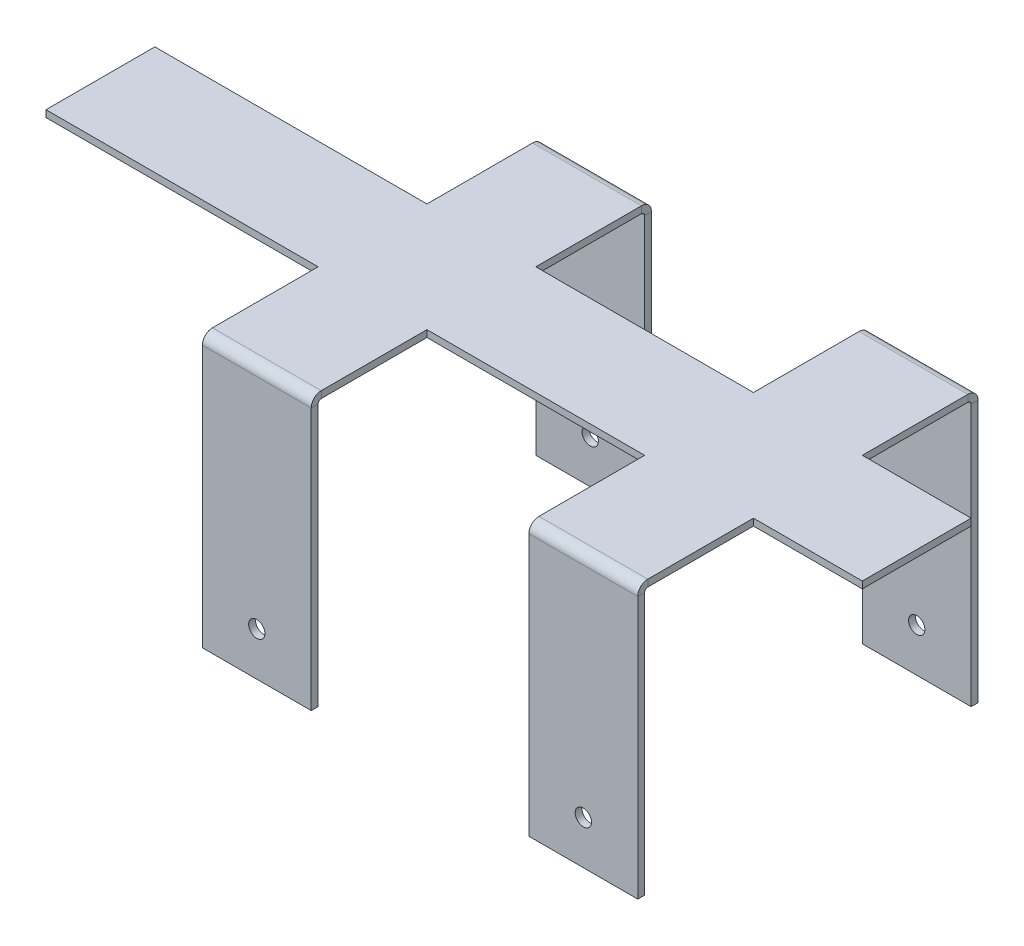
ISO-10303-21;
HEADER;
FILE_DESCRIPTION(('STEP AP214'),'2;1');
FILE_NAME('part.step','',(''),(''),'','','');
FILE_SCHEMA(('AUTOMOTIVE_DESIGN { 1 0 10303 214 1 1 1 1 }'));
ENDSEC;
DATA;
#1=APPLICATION_CONTEXT('core data for automotive mechanical design processes');
#2=APPLICATION_PROTOCOL_DEFINITION('international standard','automotive_design',2000,#1);
#3=PRODUCT_CONTEXT('',#1,'mechanical');
#4=PRODUCT('Part','Part','',(#3));
#5=PRODUCT_RELATED_PRODUCT_CATEGORY('part','',(#4));
#6=PRODUCT_DEFINITION_FORMATION('','',#4);
#7=PRODUCT_DEFINITION_CONTEXT('part definition',#1,'design');
#8=PRODUCT_DEFINITION('design','',#6,#7);
#9=PRODUCT_DEFINITION_SHAPE('','',#8);
#10=(LENGTH_UNIT() NAMED_UNIT(*) SI_UNIT(.MILLI.,.METRE.));
#11=(NAMED_UNIT(*) PLANE_ANGLE_UNIT() SI_UNIT($,.RADIAN.));
#12=(NAMED_UNIT(*) SI_UNIT($,.STERADIAN.) SOLID_ANGLE_UNIT());
#13=UNCERTAINTY_MEASURE_WITH_UNIT(LENGTH_MEASURE(1.E-05),#10,'distance_accuracy_value','');
#14=(GEOMETRIC_REPRESENTATION_CONTEXT(3) GLOBAL_UNCERTAINTY_ASSIGNED_CONTEXT((#13)) GLOBAL_UNIT_ASSIGNED_CONTEXT((#10,
#11,#12)) REPRESENTATION_CONTEXT('',''));
#15=CARTESIAN_POINT('',(0.,0.,0.));
#16=DIRECTION('',(0.,0.,1.));
#17=DIRECTION('',(1.,0.,0.));
#18=AXIS2_PLACEMENT_3D('',#15,#16,#17);
#19=CARTESIAN_POINT('',(0.,-1.6002,0.));
#20=DIRECTION('',(0.,1.,0.));
#21=DIRECTION('',(0.,0.,1.));
#22=AXIS2_PLACEMENT_3D('',#19,#20,#21);
#23=PLANE('',#22);
#24=DIRECTION('',(1.,0.,0.));
#25=VECTOR('',#24,1.);
#26=CARTESIAN_POINT('',(-6.35000000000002,-1.60020000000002,-37.3634));
#27=LINE('',#26,#25);
#28=CARTESIAN_POINT('',(-6.35000000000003,-1.60020000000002,-37.3634));
#29=VERTEX_POINT('',#28);
#30=CARTESIAN_POINT('',(-31.75,-1.60020000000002,-37.3634));
#31=VERTEX_POINT('',#30);
#32=EDGE_CURVE('E312',#29,#31,#27,.F.);
#33=ORIENTED_EDGE('',*,*,#32,.F.);
#34=DIRECTION('',(0.,0.,-1.));
#35=VECTOR('',#34,1.);
#36=CARTESIAN_POINT('',(-6.35000000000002,-1.6002,-38.1));
#37=LINE('',#36,#35);
#38=CARTESIAN_POINT('',(-6.35000000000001,-1.6002,-12.7));
#39=VERTEX_POINT('',#38);
#40=EDGE_CURVE('E502',#39,#29,#37,.T.);
#41=ORIENTED_EDGE('',*,*,#40,.F.);
#42=DIRECTION('',(-1.,0.,0.));
#43=VECTOR('',#42,1.);
#44=CARTESIAN_POINT('',(19.05,-1.6002,-12.7));
#45=LINE('',#44,#43);
#46=CARTESIAN_POINT('',(44.45,-1.6002,-12.7));
#47=VERTEX_POINT('',#46);
#48=EDGE_CURVE('E500',#47,#39,#45,.T.);
#49=ORIENTED_EDGE('',*,*,#48,.F.);
#50=DIRECTION('',(0.,0.,1.));
#51=VECTOR('',#50,1.);
#52=CARTESIAN_POINT('',(44.45,-1.6002,-38.1));
#53=LINE('',#52,#51);
#54=CARTESIAN_POINT('',(44.45,-1.60020000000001,-37.3634));
#55=VERTEX_POINT('',#54);
#56=EDGE_CURVE('E498',#55,#47,#53,.T.);
#57=ORIENTED_EDGE('',*,*,#56,.F.);
#58=DIRECTION('',(1.,0.,0.));
#59=VECTOR('',#58,1.);
#60=CARTESIAN_POINT('',(69.85,-1.60020000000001,-37.3634));
#61=LINE('',#60,#59);
#62=CARTESIAN_POINT('',(69.85,-1.60020000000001,-37.3634));
#63=VERTEX_POINT('',#62);
#64=EDGE_CURVE('E372',#63,#55,#61,.F.);
#65=ORIENTED_EDGE('',*,*,#64,.F.);
#66=DIRECTION('',(0.,0.,-1.));
#67=VECTOR('',#66,1.);
#68=CARTESIAN_POINT('',(69.85,-1.6002,-12.7));
#69=LINE('',#68,#67);
#70=CARTESIAN_POINT('',(69.85,-1.6002,-12.7));
#71=VERTEX_POINT('',#70);
#72=EDGE_CURVE('E496',#71,#63,#69,.T.);
#73=ORIENTED_EDGE('',*,*,#72,.F.);
#74=DIRECTION('',(-1.,0.,0.));
#75=VECTOR('',#74,1.);
#76=CARTESIAN_POINT('',(69.85,-1.6002,-12.7));
#77=LINE('',#76,#75);
#78=CARTESIAN_POINT('',(95.25,-1.6002,-12.7));
#79=VERTEX_POINT('',#78);
#80=EDGE_CURVE('E216',#79,#71,#77,.T.);
#81=ORIENTED_EDGE('',*,*,#80,.F.);
#82=DIRECTION('',(0.,0.,-1.));
#83=VECTOR('',#82,1.);
#84=CARTESIAN_POINT('',(95.25,-1.6002,12.7));
#85=LINE('',#84,#83);
#86=CARTESIAN_POINT('',(95.25,-1.6002,12.7));
#87=VERTEX_POINT('',#86);
#88=EDGE_CURVE('E169',#87,#79,#85,.T.);
#89=ORIENTED_EDGE('',*,*,#88,.F.);
#90=DIRECTION('',(1.,0.,0.));
#91=VECTOR('',#90,1.);
#92=CARTESIAN_POINT('',(69.85,-1.6002,12.7));
#93=LINE('',#92,#91);
#94=CARTESIAN_POINT('',(69.85,-1.6002,12.7));
#95=VERTEX_POINT('',#94);
#96=EDGE_CURVE('E157',#95,#87,#93,.T.);
#97=ORIENTED_EDGE('',*,*,#96,.F.);
#98=DIRECTION('',(0.,0.,-1.));
#99=VECTOR('',#98,1.);
#100=CARTESIAN_POINT('',(69.85,-1.6002,12.7));
#101=LINE('',#100,#99);
#102=CARTESIAN_POINT('',(69.85,-1.60020000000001,37.3634));
#103=VERTEX_POINT('',#102);
#104=EDGE_CURVE('E145',#103,#95,#101,.T.);
#105=ORIENTED_EDGE('',*,*,#104,.F.);
#106=DIRECTION('',(-1.,0.,0.));
#107=VECTOR('',#106,1.);
#108=CARTESIAN_POINT('',(44.45,-1.60020000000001,37.3634));
#109=LINE('',#108,#107);
#110=CARTESIAN_POINT('',(44.45,-1.60020000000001,37.3634));
#111=VERTEX_POINT('',#110);
#112=EDGE_CURVE('E432',#111,#103,#109,.F.);
#113=ORIENTED_EDGE('',*,*,#112,.F.);
#114=DIRECTION('',(0.,0.,1.));
#115=VECTOR('',#114,1.);
#116=CARTESIAN_POINT('',(44.45,-1.6002,38.1));
#117=LINE('',#116,#115);
#118=CARTESIAN_POINT('',(44.45,-1.6002,12.7));
#119=VERTEX_POINT('',#118);
#120=EDGE_CURVE('E158',#119,#111,#117,.T.);
#121=ORIENTED_EDGE('',*,*,#120,.F.);
#122=DIRECTION('',(1.,0.,0.));
#123=VECTOR('',#122,1.);
#124=CARTESIAN_POINT('',(-6.35000000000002,-1.6002,12.7));
#125=LINE('',#124,#123);
#126=CARTESIAN_POINT('',(-6.35000000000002,-1.6002,12.7));
#127=VERTEX_POINT('',#126);
#128=EDGE_CURVE('E521',#127,#119,#125,.T.);
#129=ORIENTED_EDGE('',*,*,#128,.F.);
#130=DIRECTION('',(0.,0.,-1.));
#131=VECTOR('',#130,1.);
#132=CARTESIAN_POINT('',(-6.35000000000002,-1.6002,38.1));
#133=LINE('',#132,#131);
#134=CARTESIAN_POINT('',(-6.35000000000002,-1.6002,37.3634));
#135=VERTEX_POINT('',#134);
#136=EDGE_CURVE('E519',#135,#127,#133,.T.);
#137=ORIENTED_EDGE('',*,*,#136,.F.);
#138=DIRECTION('',(-1.,0.,0.));
#139=VECTOR('',#138,1.);
#140=CARTESIAN_POINT('',(-31.75,-1.6002,37.3634));
#141=LINE('',#140,#139);
#142=CARTESIAN_POINT('',(-31.75,-1.6002,37.3634));
#143=VERTEX_POINT('',#142);
#144=EDGE_CURVE('E487',#143,#135,#141,.F.);
#145=ORIENTED_EDGE('',*,*,#144,.F.);
#146=DIRECTION('',(0.,0.,1.));
#147=VECTOR('',#146,1.);
#148=CARTESIAN_POINT('',(-31.75,-1.6002,12.7));
#149=LINE('',#148,#147);
#150=CARTESIAN_POINT('',(-31.75,-1.6002,12.7));
#151=VERTEX_POINT('',#150);
#152=EDGE_CURVE('E516',#151,#143,#149,.T.);
#153=ORIENTED_EDGE('',*,*,#152,.F.);
#154=DIRECTION('',(1.,0.,0.));
#155=VECTOR('',#154,1.);
#156=CARTESIAN_POINT('',(-95.25,-1.6002,12.7));
#157=LINE('',#156,#155);
#158=CARTESIAN_POINT('',(-95.25,-1.6002,12.7));
#159=VERTEX_POINT('',#158);
#160=EDGE_CURVE('E513',#159,#151,#157,.T.);
#161=ORIENTED_EDGE('',*,*,#160,.F.);
#162=DIRECTION('',(0.,0.,1.));
#163=VECTOR('',#162,1.);
#164=CARTESIAN_POINT('',(-95.25,-1.6002,12.7));
#165=LINE('',#164,#163);
#166=CARTESIAN_POINT('',(-95.25,-1.6002,-12.7));
#167=VERTEX_POINT('',#166);
#168=EDGE_CURVE('E510',#167,#159,#165,.T.);
#169=ORIENTED_EDGE('',*,*,#168,.F.);
#170=DIRECTION('',(-1.,0.,0.));
#171=VECTOR('',#170,1.);
#172=CARTESIAN_POINT('',(-95.25,-1.6002,-12.7));
#173=LINE('',#172,#171);
#174=CARTESIAN_POINT('',(-31.75,-1.6002,-12.7));
#175=VERTEX_POINT('',#174);
#176=EDGE_CURVE('E507',#175,#167,#173,.T.);
#177=ORIENTED_EDGE('',*,*,#176,.F.);
#178=DIRECTION('',(0.,0.,1.));
#179=VECTOR('',#178,1.);
#180=CARTESIAN_POINT('',(-31.75,-1.6002,-12.7));
#181=LINE('',#180,#179);
#182=EDGE_CURVE('E505',#31,#175,#181,.T.);
#183=ORIENTED_EDGE('',*,*,#182,.F.);
#184=EDGE_LOOP('',(#33,#41,#49,#57,#65,#73,#81,#89,#97,#105,#113,#121,#129,#137,#145,#153,#161,
#169,#177,#183));
#185=FACE_BOUND('',#184,.T.);
#186=ADVANCED_FACE('F38',(#185),#23,.F.);
#187=CARTESIAN_POINT('',(0.,0.,0.));
#188=DIRECTION('',(0.,1.,0.));
#189=DIRECTION('',(0.,0.,1.));
#190=AXIS2_PLACEMENT_3D('',#187,#188,#189);
#191=PLANE('',#190);
#192=DIRECTION('',(0.,0.,-1.));
#193=VECTOR('',#192,1.);
#194=CARTESIAN_POINT('',(-6.35000000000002,0.,-38.1));
#195=LINE('',#194,#193);
#196=CARTESIAN_POINT('',(-6.35000000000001,0.,-12.7));
#197=VERTEX_POINT('',#196);
#198=CARTESIAN_POINT('',(-6.35000000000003,0.,-37.3634));
#199=VERTEX_POINT('',#198);
#200=EDGE_CURVE('E186',#197,#199,#195,.T.);
#201=ORIENTED_EDGE('',*,*,#200,.T.);
#202=DIRECTION('',(1.,0.,0.));
#203=VECTOR('',#202,1.);
#204=CARTESIAN_POINT('',(-6.35000000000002,0.,-37.3634));
#205=LINE('',#204,#203);
#206=CARTESIAN_POINT('',(-31.75,0.,-37.3634));
#207=VERTEX_POINT('',#206);
#208=EDGE_CURVE('E299',#199,#207,#205,.F.);
#209=ORIENTED_EDGE('',*,*,#208,.T.);
#210=DIRECTION('',(0.,0.,1.));
#211=VECTOR('',#210,1.);
#212=CARTESIAN_POINT('',(-31.75,0.,-12.7));
#213=LINE('',#212,#211);
#214=CARTESIAN_POINT('',(-31.75,0.,-12.7));
#215=VERTEX_POINT('',#214);
#216=EDGE_CURVE('E189',#207,#215,#213,.T.);
#217=ORIENTED_EDGE('',*,*,#216,.T.);
#218=DIRECTION('',(-1.,0.,0.));
#219=VECTOR('',#218,1.);
#220=CARTESIAN_POINT('',(-95.25,0.,-12.7));
#221=LINE('',#220,#219);
#222=CARTESIAN_POINT('',(-95.25,0.,-12.7));
#223=VERTEX_POINT('',#222);
#224=EDGE_CURVE('E191',#215,#223,#221,.T.);
#225=ORIENTED_EDGE('',*,*,#224,.T.);
#226=DIRECTION('',(0.,0.,1.));
#227=VECTOR('',#226,1.);
#228=CARTESIAN_POINT('',(-95.25,0.,12.7));
#229=LINE('',#228,#227);
#230=CARTESIAN_POINT('',(-95.25,0.,12.7));
#231=VERTEX_POINT('',#230);
#232=EDGE_CURVE('E194',#223,#231,#229,.T.);
#233=ORIENTED_EDGE('',*,*,#232,.T.);
#234=DIRECTION('',(1.,0.,0.));
#235=VECTOR('',#234,1.);
#236=CARTESIAN_POINT('',(-95.25,0.,12.7));
#237=LINE('',#236,#235);
#238=CARTESIAN_POINT('',(-31.75,0.,12.7));
#239=VERTEX_POINT('',#238);
#240=EDGE_CURVE('E197',#231,#239,#237,.T.);
#241=ORIENTED_EDGE('',*,*,#240,.T.);
#242=DIRECTION('',(0.,0.,1.));
#243=VECTOR('',#242,1.);
#244=CARTESIAN_POINT('',(-31.75,0.,12.7));
#245=LINE('',#244,#243);
#246=CARTESIAN_POINT('',(-31.75,0.,37.3634));
#247=VERTEX_POINT('',#246);
#248=EDGE_CURVE('E200',#239,#247,#245,.T.);
#249=ORIENTED_EDGE('',*,*,#248,.T.);
#250=DIRECTION('',(-1.,0.,0.));
#251=VECTOR('',#250,1.);
#252=CARTESIAN_POINT('',(-31.75,0.,37.3634));
#253=LINE('',#252,#251);
#254=CARTESIAN_POINT('',(-6.35000000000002,0.,37.3634));
#255=VERTEX_POINT('',#254);
#256=EDGE_CURVE('E476',#247,#255,#253,.F.);
#257=ORIENTED_EDGE('',*,*,#256,.T.);
#258=DIRECTION('',(0.,0.,-1.));
#259=VECTOR('',#258,1.);
#260=CARTESIAN_POINT('',(-6.35000000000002,0.,38.1));
#261=LINE('',#260,#259);
#262=CARTESIAN_POINT('',(-6.35000000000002,0.,12.7));
#263=VERTEX_POINT('',#262);
#264=EDGE_CURVE('E203',#255,#263,#261,.T.);
#265=ORIENTED_EDGE('',*,*,#264,.T.);
#266=DIRECTION('',(1.,0.,0.));
#267=VECTOR('',#266,1.);
#268=CARTESIAN_POINT('',(-6.35000000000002,0.,12.7));
#269=LINE('',#268,#267);
#270=CARTESIAN_POINT('',(44.45,0.,12.7));
#271=VERTEX_POINT('',#270);
#272=EDGE_CURVE('E205',#263,#271,#269,.T.);
#273=ORIENTED_EDGE('',*,*,#272,.T.);
#274=DIRECTION('',(0.,0.,1.));
#275=VECTOR('',#274,1.);
#276=CARTESIAN_POINT('',(44.45,0.,38.1));
#277=LINE('',#276,#275);
#278=CARTESIAN_POINT('',(44.45,0.,37.3634));
#279=VERTEX_POINT('',#278);
#280=EDGE_CURVE('E208',#271,#279,#277,.T.);
#281=ORIENTED_EDGE('',*,*,#280,.T.);
#282=DIRECTION('',(-1.,0.,0.));
#283=VECTOR('',#282,1.);
#284=CARTESIAN_POINT('',(44.45,0.,37.3634));
#285=LINE('',#284,#283);
#286=CARTESIAN_POINT('',(69.85,0.,37.3634));
#287=VERTEX_POINT('',#286);
#288=EDGE_CURVE('E419',#279,#287,#285,.F.);
#289=ORIENTED_EDGE('',*,*,#288,.T.);
#290=DIRECTION('',(0.,0.,-1.));
#291=VECTOR('',#290,1.);
#292=CARTESIAN_POINT('',(69.85,0.,12.7));
#293=LINE('',#292,#291);
#294=CARTESIAN_POINT('',(69.85,0.,12.7));
#295=VERTEX_POINT('',#294);
#296=EDGE_CURVE('E211',#287,#295,#293,.T.);
#297=ORIENTED_EDGE('',*,*,#296,.T.);
#298=DIRECTION('',(1.,0.,0.));
#299=VECTOR('',#298,1.);
#300=CARTESIAN_POINT('',(69.85,0.,12.7));
#301=LINE('',#300,#299);
#302=CARTESIAN_POINT('',(95.25,0.,12.7));
#303=VERTEX_POINT('',#302);
#304=EDGE_CURVE('E165',#295,#303,#301,.T.);
#305=ORIENTED_EDGE('',*,*,#304,.T.);
#306=DIRECTION('',(0.,0.,-1.));
#307=VECTOR('',#306,1.);
#308=CARTESIAN_POINT('',(95.25,0.,12.7));
#309=LINE('',#308,#307);
#310=CARTESIAN_POINT('',(95.25,0.,-12.7));
#311=VERTEX_POINT('',#310);
#312=EDGE_CURVE('E214',#303,#311,#309,.T.);
#313=ORIENTED_EDGE('',*,*,#312,.T.);
#314=DIRECTION('',(-1.,0.,0.));
#315=VECTOR('',#314,1.);
#316=CARTESIAN_POINT('',(69.85,0.,-12.7));
#317=LINE('',#316,#315);
#318=CARTESIAN_POINT('',(69.85,0.,-12.7));
#319=VERTEX_POINT('',#318);
#320=EDGE_CURVE('E174',#311,#319,#317,.T.);
#321=ORIENTED_EDGE('',*,*,#320,.T.);
#322=DIRECTION('',(0.,0.,-1.));
#323=VECTOR('',#322,1.);
#324=CARTESIAN_POINT('',(69.85,0.,-12.7));
#325=LINE('',#324,#323);
#326=CARTESIAN_POINT('',(69.85,0.,-37.3634));
#327=VERTEX_POINT('',#326);
#328=EDGE_CURVE('E177',#319,#327,#325,.T.);
#329=ORIENTED_EDGE('',*,*,#328,.T.);
#330=DIRECTION('',(1.,0.,0.));
#331=VECTOR('',#330,1.);
#332=CARTESIAN_POINT('',(69.85,0.,-37.3634));
#333=LINE('',#332,#331);
#334=CARTESIAN_POINT('',(44.45,0.,-37.3634));
#335=VERTEX_POINT('',#334);
#336=EDGE_CURVE('E359',#327,#335,#333,.F.);
#337=ORIENTED_EDGE('',*,*,#336,.T.);
#338=DIRECTION('',(0.,0.,1.));
#339=VECTOR('',#338,1.);
#340=CARTESIAN_POINT('',(44.45,0.,-38.1));
#341=LINE('',#340,#339);
#342=CARTESIAN_POINT('',(44.45,0.,-12.7));
#343=VERTEX_POINT('',#342);
#344=EDGE_CURVE('E181',#335,#343,#341,.T.);
#345=ORIENTED_EDGE('',*,*,#344,.T.);
#346=DIRECTION('',(-1.,0.,0.));
#347=VECTOR('',#346,1.);
#348=CARTESIAN_POINT('',(-6.35000000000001,0.,-12.7));
#349=LINE('',#348,#347);
#350=EDGE_CURVE('E183',#343,#197,#349,.T.);
#351=ORIENTED_EDGE('',*,*,#350,.T.);
#352=EDGE_LOOP('',(#201,#209,#217,#225,#233,#241,#249,#257,#265,#273,#281,#289,#297,#305,#313,
#321,#329,#337,#345,#351));
#353=FACE_BOUND('',#352,.T.);
#354=ADVANCED_FACE('F581',(#353),#191,.T.);
#355=CARTESIAN_POINT('',(-6.35000000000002,-1.6002,-38.1));
#356=DIRECTION('',(1.,0.,0.));
#357=DIRECTION('',(0.,0.,-1.));
#358=AXIS2_PLACEMENT_3D('',#355,#356,#357);
#359=PLANE('',#358);
#360=ORIENTED_EDGE('',*,*,#40,.T.);
#361=DIRECTION('',(0.,1.,0.));
#362=VECTOR('',#361,1.);
#363=CARTESIAN_POINT('',(-6.35000000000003,-1.60020000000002,-37.3634));
#364=LINE('',#363,#362);
#365=EDGE_CURVE('E306',#29,#199,#364,.T.);
#366=ORIENTED_EDGE('',*,*,#365,.T.);
#367=ORIENTED_EDGE('',*,*,#200,.F.);
#368=DIRECTION('',(0.,1.,0.));
#369=VECTOR('',#368,1.);
#370=CARTESIAN_POINT('',(-6.35000000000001,-1.6002,-12.7));
#371=LINE('',#370,#369);
#372=EDGE_CURVE('E232',#39,#197,#371,.T.);
#373=ORIENTED_EDGE('',*,*,#372,.F.);
#374=EDGE_LOOP('',(#360,#366,#367,#373));
#375=FACE_BOUND('',#374,.T.);
#376=ADVANCED_FACE('F740',(#375),#359,.T.);
#377=CARTESIAN_POINT('',(69.85,-1.6002,-12.7));
#378=DIRECTION('',(1.,0.,0.));
#379=DIRECTION('',(0.,0.,-1.));
#380=AXIS2_PLACEMENT_3D('',#377,#378,#379);
#381=PLANE('',#380);
#382=ORIENTED_EDGE('',*,*,#72,.T.);
#383=DIRECTION('',(0.,1.,0.));
#384=VECTOR('',#383,1.);
#385=CARTESIAN_POINT('',(69.85,-1.60020000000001,-37.3634));
#386=LINE('',#385,#384);
#387=EDGE_CURVE('E366',#63,#327,#386,.T.);
#388=ORIENTED_EDGE('',*,*,#387,.T.);
#389=ORIENTED_EDGE('',*,*,#328,.F.);
#390=DIRECTION('',(0.,1.,0.));
#391=VECTOR('',#390,1.);
#392=CARTESIAN_POINT('',(69.85,-1.6002,-12.7));
#393=LINE('',#392,#391);
#394=EDGE_CURVE('E113',#71,#319,#393,.T.);
#395=ORIENTED_EDGE('',*,*,#394,.F.);
#396=EDGE_LOOP('',(#382,#388,#389,#395));
#397=FACE_BOUND('',#396,.T.);
#398=ADVANCED_FACE('F754',(#397),#381,.T.);
#399=CARTESIAN_POINT('',(44.45,-1.6002,38.1));
#400=DIRECTION('',(-1.,0.,0.));
#401=DIRECTION('',(0.,0.,1.));
#402=AXIS2_PLACEMENT_3D('',#399,#400,#401);
#403=PLANE('',#402);
#404=ORIENTED_EDGE('',*,*,#120,.T.);
#405=DIRECTION('',(0.,1.,0.));
#406=VECTOR('',#405,1.);
#407=CARTESIAN_POINT('',(44.45,-1.60020000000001,37.3634));
#408=LINE('',#407,#406);
#409=EDGE_CURVE('E426',#111,#279,#408,.T.);
#410=ORIENTED_EDGE('',*,*,#409,.T.);
#411=ORIENTED_EDGE('',*,*,#280,.F.);
#412=DIRECTION('',(0.,1.,0.));
#413=VECTOR('',#412,1.);
#414=CARTESIAN_POINT('',(44.45,-1.6002,12.7));
#415=LINE('',#414,#413);
#416=EDGE_CURVE('E166',#119,#271,#415,.T.);
#417=ORIENTED_EDGE('',*,*,#416,.F.);
#418=EDGE_LOOP('',(#404,#410,#411,#417));
#419=FACE_BOUND('',#418,.T.);
#420=ADVANCED_FACE('F527',(#419),#403,.T.);
#421=CARTESIAN_POINT('',(-31.75,-1.6002,12.7));
#422=DIRECTION('',(-1.,0.,0.));
#423=DIRECTION('',(0.,0.,1.));
#424=AXIS2_PLACEMENT_3D('',#421,#422,#423);
#425=PLANE('',#424);
#426=ORIENTED_EDGE('',*,*,#152,.T.);
#427=DIRECTION('',(0.,1.,0.));
#428=VECTOR('',#427,1.);
#429=CARTESIAN_POINT('',(-31.75,-1.6002,37.3634));
#430=LINE('',#429,#428);
#431=EDGE_CURVE('E481',#143,#247,#430,.T.);
#432=ORIENTED_EDGE('',*,*,#431,.T.);
#433=ORIENTED_EDGE('',*,*,#248,.F.);
#434=DIRECTION('',(0.,1.,0.));
#435=VECTOR('',#434,1.);
#436=CARTESIAN_POINT('',(-31.75,-1.6002,12.7));
#437=LINE('',#436,#435);
#438=EDGE_CURVE('E223',#151,#239,#437,.T.);
#439=ORIENTED_EDGE('',*,*,#438,.F.);
#440=EDGE_LOOP('',(#426,#432,#433,#439));
#441=FACE_BOUND('',#440,.T.);
#442=ADVANCED_FACE('F630',(#441),#425,.T.);
#443=CARTESIAN_POINT('',(69.85,-1.6002,-12.7));
#444=DIRECTION('',(0.,0.,-1.));
#445=DIRECTION('',(-1.,0.,0.));
#446=AXIS2_PLACEMENT_3D('',#443,#444,#445);
#447=PLANE('',#446);
#448=ORIENTED_EDGE('',*,*,#320,.F.);
#449=DIRECTION('',(0.,1.,0.));
#450=VECTOR('',#449,1.);
#451=CARTESIAN_POINT('',(95.25,-1.6002,-12.7));
#452=LINE('',#451,#450);
#453=EDGE_CURVE('E11',#79,#311,#452,.T.);
#454=ORIENTED_EDGE('',*,*,#453,.F.);
#455=ORIENTED_EDGE('',*,*,#80,.T.);
#456=ORIENTED_EDGE('',*,*,#394,.T.);
#457=EDGE_LOOP('',(#448,#454,#455,#456));
#458=FACE_BOUND('',#457,.T.);
#459=ADVANCED_FACE('F40',(#458),#447,.T.);
#460=CARTESIAN_POINT('',(95.25,-1.6002,12.7));
#461=DIRECTION('',(1.,0.,0.));
#462=DIRECTION('',(0.,0.,-1.));
#463=AXIS2_PLACEMENT_3D('',#460,#461,#462);
#464=PLANE('',#463);
#465=ORIENTED_EDGE('',*,*,#312,.F.);
#466=DIRECTION('',(0.,1.,0.));
#467=VECTOR('',#466,1.);
#468=CARTESIAN_POINT('',(95.25,-1.6002,12.7));
#469=LINE('',#468,#467);
#470=EDGE_CURVE('E47',#87,#303,#469,.T.);
#471=ORIENTED_EDGE('',*,*,#470,.F.);
#472=ORIENTED_EDGE('',*,*,#88,.T.);
#473=ORIENTED_EDGE('',*,*,#453,.T.);
#474=EDGE_LOOP('',(#465,#471,#472,#473));
#475=FACE_BOUND('',#474,.T.);
#476=ADVANCED_FACE('F745',(#475),#464,.T.);
#477=CARTESIAN_POINT('',(69.85,-1.6002,12.7));
#478=DIRECTION('',(0.,0.,1.));
#479=DIRECTION('',(1.,0.,0.));
#480=AXIS2_PLACEMENT_3D('',#477,#478,#479);
#481=PLANE('',#480);
#482=ORIENTED_EDGE('',*,*,#304,.F.);
#483=DIRECTION('',(0.,1.,0.));
#484=VECTOR('',#483,1.);
#485=CARTESIAN_POINT('',(69.85,-1.6002,12.7));
#486=LINE('',#485,#484);
#487=EDGE_CURVE('E149',#95,#295,#486,.T.);
#488=ORIENTED_EDGE('',*,*,#487,.F.);
#489=ORIENTED_EDGE('',*,*,#96,.T.);
#490=ORIENTED_EDGE('',*,*,#470,.T.);
#491=EDGE_LOOP('',(#482,#488,#489,#490));
#492=FACE_BOUND('',#491,.T.);
#493=ADVANCED_FACE('F162',(#492),#481,.T.);
#494=CARTESIAN_POINT('',(69.85,-1.6002,12.7));
#495=DIRECTION('',(1.,0.,0.));
#496=DIRECTION('',(0.,0.,-1.));
#497=AXIS2_PLACEMENT_3D('',#494,#495,#496);
#498=PLANE('',#497);
#499=DIRECTION('',(0.,1.,0.));
#500=VECTOR('',#499,1.);
#501=CARTESIAN_POINT('',(69.85,-1.60020000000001,37.3634));
#502=LINE('',#501,#500);
#503=EDGE_CURVE('E153',#103,#287,#502,.T.);
#504=ORIENTED_EDGE('',*,*,#503,.F.);
#505=ORIENTED_EDGE('',*,*,#104,.T.);
#506=ORIENTED_EDGE('',*,*,#487,.T.);
#507=ORIENTED_EDGE('',*,*,#296,.F.);
#508=EDGE_LOOP('',(#504,#505,#506,#507));
#509=FACE_BOUND('',#508,.T.);
#510=ADVANCED_FACE('F147',(#509),#498,.T.);
#511=CARTESIAN_POINT('',(-6.35000000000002,-1.6002,12.7));
#512=DIRECTION('',(0.,0.,1.));
#513=DIRECTION('',(1.,0.,0.));
#514=AXIS2_PLACEMENT_3D('',#511,#512,#513);
#515=PLANE('',#514);
#516=ORIENTED_EDGE('',*,*,#272,.F.);
#517=DIRECTION('',(0.,1.,0.));
#518=VECTOR('',#517,1.);
#519=CARTESIAN_POINT('',(-6.35000000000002,-1.6002,12.7));
#520=LINE('',#519,#518);
#521=EDGE_CURVE('E220',#127,#263,#520,.T.);
#522=ORIENTED_EDGE('',*,*,#521,.F.);
#523=ORIENTED_EDGE('',*,*,#128,.T.);
#524=ORIENTED_EDGE('',*,*,#416,.T.);
#525=EDGE_LOOP('',(#516,#522,#523,#524));
#526=FACE_BOUND('',#525,.T.);
#527=ADVANCED_FACE('F538',(#526),#515,.T.);
#528=CARTESIAN_POINT('',(-6.35000000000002,-1.6002,38.1));
#529=DIRECTION('',(1.,0.,0.));
#530=DIRECTION('',(0.,0.,-1.));
#531=AXIS2_PLACEMENT_3D('',#528,#529,#530);
#532=PLANE('',#531);
#533=DIRECTION('',(0.,1.,0.));
#534=VECTOR('',#533,1.);
#535=CARTESIAN_POINT('',(-6.35000000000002,-1.6002,37.3634));
#536=LINE('',#535,#534);
#537=EDGE_CURVE('E178',#135,#255,#536,.T.);
#538=ORIENTED_EDGE('',*,*,#537,.F.);
#539=ORIENTED_EDGE('',*,*,#136,.T.);
#540=ORIENTED_EDGE('',*,*,#521,.T.);
#541=ORIENTED_EDGE('',*,*,#264,.F.);
#542=EDGE_LOOP('',(#538,#539,#540,#541));
#543=FACE_BOUND('',#542,.T.);
#544=ADVANCED_FACE('F542',(#543),#532,.T.);
#545=CARTESIAN_POINT('',(-95.25,-1.6002,12.7));
#546=DIRECTION('',(0.,0.,1.));
#547=DIRECTION('',(1.,0.,0.));
#548=AXIS2_PLACEMENT_3D('',#545,#546,#547);
#549=PLANE('',#548);
#550=ORIENTED_EDGE('',*,*,#240,.F.);
#551=DIRECTION('',(0.,1.,0.));
#552=VECTOR('',#551,1.);
#553=CARTESIAN_POINT('',(-95.25,-1.6002,12.7));
#554=LINE('',#553,#552);
#555=EDGE_CURVE('E225',#159,#231,#554,.T.);
#556=ORIENTED_EDGE('',*,*,#555,.F.);
#557=ORIENTED_EDGE('',*,*,#160,.T.);
#558=ORIENTED_EDGE('',*,*,#438,.T.);
#559=EDGE_LOOP('',(#550,#556,#557,#558));
#560=FACE_BOUND('',#559,.T.);
#561=ADVANCED_FACE('F635',(#560),#549,.T.);
#562=CARTESIAN_POINT('',(-95.25,-1.6002,12.7));
#563=DIRECTION('',(-1.,0.,0.));
#564=DIRECTION('',(0.,0.,1.));
#565=AXIS2_PLACEMENT_3D('',#562,#563,#564);
#566=PLANE('',#565);
#567=ORIENTED_EDGE('',*,*,#232,.F.);
#568=DIRECTION('',(0.,1.,0.));
#569=VECTOR('',#568,1.);
#570=CARTESIAN_POINT('',(-95.25,-1.6002,-12.7));
#571=LINE('',#570,#569);
#572=EDGE_CURVE('E227',#167,#223,#571,.T.);
#573=ORIENTED_EDGE('',*,*,#572,.F.);
#574=ORIENTED_EDGE('',*,*,#168,.T.);
#575=ORIENTED_EDGE('',*,*,#555,.T.);
#576=EDGE_LOOP('',(#567,#573,#574,#575));
#577=FACE_BOUND('',#576,.T.);
#578=ADVANCED_FACE('F638',(#577),#566,.T.);
#579=CARTESIAN_POINT('',(-95.25,-1.6002,-12.7));
#580=DIRECTION('',(0.,0.,-1.));
#581=DIRECTION('',(-1.,0.,0.));
#582=AXIS2_PLACEMENT_3D('',#579,#580,#581);
#583=PLANE('',#582);
#584=ORIENTED_EDGE('',*,*,#224,.F.);
#585=DIRECTION('',(0.,1.,0.));
#586=VECTOR('',#585,1.);
#587=CARTESIAN_POINT('',(-31.75,-1.6002,-12.7));
#588=LINE('',#587,#586);
#589=EDGE_CURVE('E229',#175,#215,#588,.T.);
#590=ORIENTED_EDGE('',*,*,#589,.F.);
#591=ORIENTED_EDGE('',*,*,#176,.T.);
#592=ORIENTED_EDGE('',*,*,#572,.T.);
#593=EDGE_LOOP('',(#584,#590,#591,#592));
#594=FACE_BOUND('',#593,.T.);
#595=ADVANCED_FACE('F644',(#594),#583,.T.);
#596=CARTESIAN_POINT('',(-31.75,-1.6002,-12.7));
#597=DIRECTION('',(-1.,0.,0.));
#598=DIRECTION('',(0.,0.,1.));
#599=AXIS2_PLACEMENT_3D('',#596,#597,#598);
#600=PLANE('',#599);
#601=DIRECTION('',(0.,1.,0.));
#602=VECTOR('',#601,1.);
#603=CARTESIAN_POINT('',(-31.75,-1.60020000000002,-37.3634));
#604=LINE('',#603,#602);
#605=EDGE_CURVE('E317',#31,#207,#604,.T.);
#606=ORIENTED_EDGE('',*,*,#605,.F.);
#607=ORIENTED_EDGE('',*,*,#182,.T.);
#608=ORIENTED_EDGE('',*,*,#589,.T.);
#609=ORIENTED_EDGE('',*,*,#216,.F.);
#610=EDGE_LOOP('',(#606,#607,#608,#609));
#611=FACE_BOUND('',#610,.T.);
#612=ADVANCED_FACE('F648',(#611),#600,.T.);
#613=CARTESIAN_POINT('',(-6.35000000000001,-1.6002,-12.7));
#614=DIRECTION('',(0.,0.,-1.));
#615=DIRECTION('',(-1.,0.,0.));
#616=AXIS2_PLACEMENT_3D('',#613,#614,#615);
#617=PLANE('',#616);
#618=ORIENTED_EDGE('',*,*,#350,.F.);
#619=DIRECTION('',(0.,1.,0.));
#620=VECTOR('',#619,1.);
#621=CARTESIAN_POINT('',(44.45,-1.6002,-12.7));
#622=LINE('',#621,#620);
#623=EDGE_CURVE('E234',#47,#343,#622,.T.);
#624=ORIENTED_EDGE('',*,*,#623,.F.);
#625=ORIENTED_EDGE('',*,*,#48,.T.);
#626=ORIENTED_EDGE('',*,*,#372,.T.);
#627=EDGE_LOOP('',(#618,#624,#625,#626));
#628=FACE_BOUND('',#627,.T.);
#629=ADVANCED_FACE('F769',(#628),#617,.T.);
#630=CARTESIAN_POINT('',(44.45,-1.6002,-38.1));
#631=DIRECTION('',(-1.,0.,0.));
#632=DIRECTION('',(0.,0.,1.));
#633=AXIS2_PLACEMENT_3D('',#630,#631,#632);
#634=PLANE('',#633);
#635=DIRECTION('',(0.,1.,0.));
#636=VECTOR('',#635,1.);
#637=CARTESIAN_POINT('',(44.45,-1.60020000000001,-37.3634));
#638=LINE('',#637,#636);
#639=EDGE_CURVE('E377',#55,#335,#638,.T.);
#640=ORIENTED_EDGE('',*,*,#639,.F.);
#641=ORIENTED_EDGE('',*,*,#56,.T.);
#642=ORIENTED_EDGE('',*,*,#623,.T.);
#643=ORIENTED_EDGE('',*,*,#344,.F.);
#644=EDGE_LOOP('',(#640,#641,#642,#643));
#645=FACE_BOUND('',#644,.T.);
#646=ADVANCED_FACE('F775',(#645),#634,.T.);
#647=CARTESIAN_POINT('',(-6.35000000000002,-2.3368,37.3634));
#648=DIRECTION('',(1.,0.,0.));
#649=DIRECTION('',(0.,0.,-1.));
#650=AXIS2_PLACEMENT_3D('',#647,#648,#649);
#651=PLANE('',#650);
#652=DIRECTION('',(0.,0.,1.));
#653=VECTOR('',#652,1.);
#654=CARTESIAN_POINT('',(-6.35000000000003,-2.3368,38.1));
#655=LINE('',#654,#653);
#656=CARTESIAN_POINT('',(-6.35000000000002,-2.3368,38.1));
#657=VERTEX_POINT('',#656);
#658=CARTESIAN_POINT('',(-6.35000000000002,-2.33679999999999,39.7002));
#659=VERTEX_POINT('',#658);
#660=EDGE_CURVE('E438',#657,#659,#655,.T.);
#661=ORIENTED_EDGE('',*,*,#660,.F.);
#662=CARTESIAN_POINT('',(-6.35000000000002,-2.3368,37.3634));
#663=DIRECTION('',(-1.,0.,0.));
#664=DIRECTION('',(0.,0.,1.));
#665=AXIS2_PLACEMENT_3D('',#662,#663,#664);
#666=CIRCLE('',#665,0.736599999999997);
#667=EDGE_CURVE('E484',#135,#657,#666,.F.);
#668=ORIENTED_EDGE('',*,*,#667,.F.);
#669=ORIENTED_EDGE('',*,*,#537,.T.);
#670=CARTESIAN_POINT('',(-6.35000000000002,-2.3368,37.3634));
#671=DIRECTION('',(-1.,0.,0.));
#672=DIRECTION('',(0.,0.,1.));
#673=AXIS2_PLACEMENT_3D('',#670,#671,#672);
#674=CIRCLE('',#673,2.3368);
#675=EDGE_CURVE('E55',#255,#659,#674,.F.);
#676=ORIENTED_EDGE('',*,*,#675,.T.);
#677=EDGE_LOOP('',(#661,#668,#669,#676));
#678=FACE_BOUND('',#677,.T.);
#679=ADVANCED_FACE('F627',(#678),#651,.T.);
#680=CARTESIAN_POINT('',(-31.75,-2.3368,37.3634));
#681=DIRECTION('',(1.,0.,0.));
#682=DIRECTION('',(0.,0.,-1.));
#683=AXIS2_PLACEMENT_3D('',#680,#681,#682);
#684=PLANE('',#683);
#685=CARTESIAN_POINT('',(-31.75,-2.3368,37.3634));
#686=DIRECTION('',(-1.,0.,0.));
#687=DIRECTION('',(0.,0.,1.));
#688=AXIS2_PLACEMENT_3D('',#685,#686,#687);
#689=CIRCLE('',#688,0.736599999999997);
#690=CARTESIAN_POINT('',(-31.75,-2.3368,38.1));
#691=VERTEX_POINT('',#690);
#692=EDGE_CURVE('E475',#691,#143,#689,.T.);
#693=ORIENTED_EDGE('',*,*,#692,.F.);
#694=DIRECTION('',(0.,0.,1.));
#695=VECTOR('',#694,1.);
#696=CARTESIAN_POINT('',(-31.75,-2.3368,38.1));
#697=LINE('',#696,#695);
#698=CARTESIAN_POINT('',(-31.75,-2.3368,39.7002));
#699=VERTEX_POINT('',#698);
#700=EDGE_CURVE('E444',#691,#699,#697,.T.);
#701=ORIENTED_EDGE('',*,*,#700,.T.);
#702=CARTESIAN_POINT('',(-31.75,-2.3368,37.3634));
#703=DIRECTION('',(-1.,0.,0.));
#704=DIRECTION('',(0.,0.,1.));
#705=AXIS2_PLACEMENT_3D('',#702,#703,#704);
#706=CIRCLE('',#705,2.3368);
#707=EDGE_CURVE('E479',#699,#247,#706,.T.);
#708=ORIENTED_EDGE('',*,*,#707,.T.);
#709=ORIENTED_EDGE('',*,*,#431,.F.);
#710=EDGE_LOOP('',(#693,#701,#708,#709));
#711=FACE_BOUND('',#710,.T.);
#712=ADVANCED_FACE('F618',(#711),#684,.F.);
#713=CARTESIAN_POINT('',(-31.75,-2.3368,37.3634));
#714=DIRECTION('',(-1.,0.,0.));
#715=DIRECTION('',(0.,0.,1.));
#716=AXIS2_PLACEMENT_3D('',#713,#714,#715);
#717=CYLINDRICAL_SURFACE('',#716,2.3368);
#718=ORIENTED_EDGE('',*,*,#256,.F.);
#719=ORIENTED_EDGE('',*,*,#707,.F.);
#720=DIRECTION('',(1.,0.,0.));
#721=VECTOR('',#720,1.);
#722=CARTESIAN_POINT('',(0.,-2.3368,39.7002));
#723=LINE('',#722,#721);
#724=EDGE_CURVE('E447',#699,#659,#723,.T.);
#725=ORIENTED_EDGE('',*,*,#724,.T.);
#726=ORIENTED_EDGE('',*,*,#675,.F.);
#727=EDGE_LOOP('',(#718,#719,#725,#726));
#728=FACE_BOUND('',#727,.T.);
#729=ADVANCED_FACE('F625',(#728),#717,.T.);
#730=CARTESIAN_POINT('',(-31.75,-2.3368,37.3634));
#731=DIRECTION('',(-1.,0.,0.));
#732=DIRECTION('',(0.,0.,1.));
#733=AXIS2_PLACEMENT_3D('',#730,#731,#732);
#734=CYLINDRICAL_SURFACE('',#733,0.736599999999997);
#735=ORIENTED_EDGE('',*,*,#144,.T.);
#736=ORIENTED_EDGE('',*,*,#667,.T.);
#737=DIRECTION('',(-1.,0.,0.));
#738=VECTOR('',#737,1.);
#739=CARTESIAN_POINT('',(-6.35000000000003,-2.3368,38.1));
#740=LINE('',#739,#738);
#741=EDGE_CURVE('E441',#657,#691,#740,.T.);
#742=ORIENTED_EDGE('',*,*,#741,.T.);
#743=ORIENTED_EDGE('',*,*,#692,.T.);
#744=EDGE_LOOP('',(#735,#736,#742,#743));
#745=FACE_BOUND('',#744,.T.);
#746=ADVANCED_FACE('F615',(#745),#734,.F.);
#747=CARTESIAN_POINT('',(-31.75,-63.5,39.7002000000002));
#748=DIRECTION('',(1.,0.,0.));
#749=DIRECTION('',(0.,0.,-1.));
#750=AXIS2_PLACEMENT_3D('',#747,#748,#749);
#751=PLANE('',#750);
#752=ORIENTED_EDGE('',*,*,#700,.F.);
#753=DIRECTION('',(0.,-1.,0.));
#754=VECTOR('',#753,1.);
#755=CARTESIAN_POINT('',(-31.75,-63.5,38.1000000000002));
#756=LINE('',#755,#754);
#757=CARTESIAN_POINT('',(-31.75,-63.5,38.1000000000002));
#758=VERTEX_POINT('',#757);
#759=EDGE_CURVE('E451',#691,#758,#756,.T.);
#760=ORIENTED_EDGE('',*,*,#759,.T.);
#761=DIRECTION('',(0.,0.,-1.));
#762=VECTOR('',#761,1.);
#763=CARTESIAN_POINT('',(-31.75,-63.5,39.7002000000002));
#764=LINE('',#763,#762);
#765=CARTESIAN_POINT('',(-31.75,-63.5,39.7002000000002));
#766=VERTEX_POINT('',#765);
#767=EDGE_CURVE('E472',#766,#758,#764,.T.);
#768=ORIENTED_EDGE('',*,*,#767,.F.);
#769=DIRECTION('',(0.,-1.,0.));
#770=VECTOR('',#769,1.);
#771=CARTESIAN_POINT('',(-31.75,-63.5,39.7002000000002));
#772=LINE('',#771,#770);
#773=EDGE_CURVE('E452',#699,#766,#772,.T.);
#774=ORIENTED_EDGE('',*,*,#773,.F.);
#775=EDGE_LOOP('',(#752,#760,#768,#774));
#776=FACE_BOUND('',#775,.T.);
#777=ADVANCED_FACE('F622',(#776),#751,.F.);
#778=CARTESIAN_POINT('',(-6.35000000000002,-1.60019999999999,39.7002));
#779=DIRECTION('',(-1.,0.,0.));
#780=DIRECTION('',(0.,-1.,0.));
#781=AXIS2_PLACEMENT_3D('',#778,#779,#780);
#782=PLANE('',#781);
#783=ORIENTED_EDGE('',*,*,#660,.T.);
#784=DIRECTION('',(0.,1.,0.));
#785=VECTOR('',#784,1.);
#786=CARTESIAN_POINT('',(-6.35000000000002,-1.60019999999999,39.7002));
#787=LINE('',#786,#785);
#788=CARTESIAN_POINT('',(-6.35000000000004,-63.5,39.7002000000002));
#789=VERTEX_POINT('',#788);
#790=EDGE_CURVE('E459',#789,#659,#787,.T.);
#791=ORIENTED_EDGE('',*,*,#790,.F.);
#792=DIRECTION('',(0.,0.,-1.));
#793=VECTOR('',#792,1.);
#794=CARTESIAN_POINT('',(-6.35000000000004,-63.5,39.7002000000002));
#795=LINE('',#794,#793);
#796=CARTESIAN_POINT('',(-6.35000000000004,-63.5,38.1000000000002));
#797=VERTEX_POINT('',#796);
#798=EDGE_CURVE('E462',#789,#797,#795,.T.);
#799=ORIENTED_EDGE('',*,*,#798,.T.);
#800=DIRECTION('',(0.,1.,0.));
#801=VECTOR('',#800,1.);
#802=CARTESIAN_POINT('',(-6.35000000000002,-1.6002,38.1));
#803=LINE('',#802,#801);
#804=EDGE_CURVE('E456',#797,#657,#803,.T.);
#805=ORIENTED_EDGE('',*,*,#804,.T.);
#806=EDGE_LOOP('',(#783,#791,#799,#805));
#807=FACE_BOUND('',#806,.T.);
#808=ADVANCED_FACE('F611',(#807),#782,.F.);
#809=CARTESIAN_POINT('',(0.,1.37986972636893E-13,39.7002));
#810=DIRECTION('',(0.,0.,-1.));
#811=DIRECTION('',(0.,1.,0.));
#812=AXIS2_PLACEMENT_3D('',#809,#810,#811);
#813=PLANE('',#812);
#814=CARTESIAN_POINT('',(-19.05,-53.3400000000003,39.7002000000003));
#815=DIRECTION('',(0.,0.,-1.));
#816=DIRECTION('',(0.,1.,0.));
#817=AXIS2_PLACEMENT_3D('',#814,#815,#816);
#818=CIRCLE('',#817,1.905);
#819=CARTESIAN_POINT('',(-19.05,-51.4350000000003,39.7002000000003));
#820=VERTEX_POINT('',#819);
#821=EDGE_CURVE('E251',#820,#820,#818,.T.);
#822=ORIENTED_EDGE('',*,*,#821,.T.);
#823=EDGE_LOOP('',(#822));
#824=FACE_BOUND('',#823,.T.);
#825=ORIENTED_EDGE('',*,*,#724,.F.);
#826=ORIENTED_EDGE('',*,*,#773,.T.);
#827=DIRECTION('',(1.,0.,0.));
#828=VECTOR('',#827,1.);
#829=CARTESIAN_POINT('',(-6.35000000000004,-63.5,39.7002000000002));
#830=LINE('',#829,#828);
#831=EDGE_CURVE('E455',#766,#789,#830,.T.);
#832=ORIENTED_EDGE('',*,*,#831,.T.);
#833=ORIENTED_EDGE('',*,*,#790,.T.);
#834=EDGE_LOOP('',(#825,#826,#832,#833));
#835=FACE_BOUND('',#834,.T.);
#836=ADVANCED_FACE('F624',(#824,#835),#813,.F.);
#837=CARTESIAN_POINT('',(0.,1.32399904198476E-13,38.1));
#838=DIRECTION('',(0.,0.,-1.));
#839=DIRECTION('',(0.,1.,0.));
#840=AXIS2_PLACEMENT_3D('',#837,#838,#839);
#841=PLANE('',#840);
#842=CARTESIAN_POINT('',(-19.05,-53.3400000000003,38.1000000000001));
#843=DIRECTION('',(0.,0.,-1.));
#844=DIRECTION('',(0.,1.,0.));
#845=AXIS2_PLACEMENT_3D('',#842,#843,#844);
#846=CIRCLE('',#845,1.905);
#847=CARTESIAN_POINT('',(-19.05,-51.4350000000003,38.1000000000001));
#848=VERTEX_POINT('',#847);
#849=EDGE_CURVE('E239',#848,#848,#846,.T.);
#850=ORIENTED_EDGE('',*,*,#849,.F.);
#851=EDGE_LOOP('',(#850));
#852=FACE_BOUND('',#851,.T.);
#853=ORIENTED_EDGE('',*,*,#759,.F.);
#854=ORIENTED_EDGE('',*,*,#741,.F.);
#855=ORIENTED_EDGE('',*,*,#804,.F.);
#856=DIRECTION('',(1.,0.,0.));
#857=VECTOR('',#856,1.);
#858=CARTESIAN_POINT('',(-6.35000000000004,-63.5,38.1000000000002));
#859=LINE('',#858,#857);
#860=EDGE_CURVE('E465',#758,#797,#859,.T.);
#861=ORIENTED_EDGE('',*,*,#860,.F.);
#862=EDGE_LOOP('',(#853,#854,#855,#861));
#863=FACE_BOUND('',#862,.T.);
#864=ADVANCED_FACE('F613',(#852,#863),#841,.T.);
#865=CARTESIAN_POINT('',(-6.35000000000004,-63.5,39.7002000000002));
#866=DIRECTION('',(0.,1.,0.));
#867=DIRECTION('',(0.,0.,1.));
#868=AXIS2_PLACEMENT_3D('',#865,#866,#867);
#869=PLANE('',#868);
#870=ORIENTED_EDGE('',*,*,#860,.T.);
#871=ORIENTED_EDGE('',*,*,#798,.F.);
#872=ORIENTED_EDGE('',*,*,#831,.F.);
#873=ORIENTED_EDGE('',*,*,#767,.T.);
#874=EDGE_LOOP('',(#870,#871,#872,#873));
#875=FACE_BOUND('',#874,.T.);
#876=ADVANCED_FACE('F603',(#875),#869,.F.);
#877=CARTESIAN_POINT('',(69.85,-2.3368,37.3634));
#878=DIRECTION('',(1.,0.,0.));
#879=DIRECTION('',(0.,0.,-1.));
#880=AXIS2_PLACEMENT_3D('',#877,#878,#879);
#881=PLANE('',#880);
#882=DIRECTION('',(0.,0.,1.));
#883=VECTOR('',#882,1.);
#884=CARTESIAN_POINT('',(69.85,-2.3368,38.1));
#885=LINE('',#884,#883);
#886=CARTESIAN_POINT('',(69.85,-2.3368,38.1));
#887=VERTEX_POINT('',#886);
#888=CARTESIAN_POINT('',(69.85,-2.33679999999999,39.7002));
#889=VERTEX_POINT('',#888);
#890=EDGE_CURVE('E380',#887,#889,#885,.T.);
#891=ORIENTED_EDGE('',*,*,#890,.F.);
#892=CARTESIAN_POINT('',(69.85,-2.3368,37.3634));
#893=DIRECTION('',(-1.,0.,0.));
#894=DIRECTION('',(0.,0.,1.));
#895=AXIS2_PLACEMENT_3D('',#892,#893,#894);
#896=CIRCLE('',#895,0.73659999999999);
#897=EDGE_CURVE('E429',#103,#887,#896,.F.);
#898=ORIENTED_EDGE('',*,*,#897,.F.);
#899=ORIENTED_EDGE('',*,*,#503,.T.);
#900=CARTESIAN_POINT('',(69.85,-2.3368,37.3634));
#901=DIRECTION('',(-1.,0.,0.));
#902=DIRECTION('',(0.,0.,1.));
#903=AXIS2_PLACEMENT_3D('',#900,#901,#902);
#904=CIRCLE('',#903,2.33679999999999);
#905=EDGE_CURVE('E422',#287,#889,#904,.F.);
#906=ORIENTED_EDGE('',*,*,#905,.T.);
#907=EDGE_LOOP('',(#891,#898,#899,#906));
#908=FACE_BOUND('',#907,.T.);
#909=ADVANCED_FACE('F579',(#908),#881,.T.);
#910=CARTESIAN_POINT('',(44.45,-2.3368,37.3634));
#911=DIRECTION('',(1.,0.,0.));
#912=DIRECTION('',(0.,0.,-1.));
#913=AXIS2_PLACEMENT_3D('',#910,#911,#912);
#914=PLANE('',#913);
#915=CARTESIAN_POINT('',(44.45,-2.3368,37.3634));
#916=DIRECTION('',(-1.,0.,0.));
#917=DIRECTION('',(0.,0.,1.));
#918=AXIS2_PLACEMENT_3D('',#915,#916,#917);
#919=CIRCLE('',#918,0.73659999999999);
#920=CARTESIAN_POINT('',(44.45,-2.3368,38.1));
#921=VERTEX_POINT('',#920);
#922=EDGE_CURVE('E418',#921,#111,#919,.T.);
#923=ORIENTED_EDGE('',*,*,#922,.F.);
#924=DIRECTION('',(0.,0.,1.));
#925=VECTOR('',#924,1.);
#926=CARTESIAN_POINT('',(44.45,-2.3368,38.1));
#927=LINE('',#926,#925);
#928=CARTESIAN_POINT('',(44.45,-2.3368,39.7002));
#929=VERTEX_POINT('',#928);
#930=EDGE_CURVE('E386',#921,#929,#927,.T.);
#931=ORIENTED_EDGE('',*,*,#930,.T.);
#932=CARTESIAN_POINT('',(44.45,-2.3368,37.3634));
#933=DIRECTION('',(-1.,0.,0.));
#934=DIRECTION('',(0.,0.,1.));
#935=AXIS2_PLACEMENT_3D('',#932,#933,#934);
#936=CIRCLE('',#935,2.33679999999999);
#937=EDGE_CURVE('E423',#929,#279,#936,.T.);
#938=ORIENTED_EDGE('',*,*,#937,.T.);
#939=ORIENTED_EDGE('',*,*,#409,.F.);
#940=EDGE_LOOP('',(#923,#931,#938,#939));
#941=FACE_BOUND('',#940,.T.);
#942=ADVANCED_FACE('F719',(#941),#914,.F.);
#943=CARTESIAN_POINT('',(44.45,-2.3368,37.3634));
#944=DIRECTION('',(-1.,0.,0.));
#945=DIRECTION('',(0.,0.,1.));
#946=AXIS2_PLACEMENT_3D('',#943,#944,#945);
#947=CYLINDRICAL_SURFACE('',#946,2.33679999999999);
#948=ORIENTED_EDGE('',*,*,#288,.F.);
#949=ORIENTED_EDGE('',*,*,#937,.F.);
#950=DIRECTION('',(1.,0.,0.));
#951=VECTOR('',#950,1.);
#952=CARTESIAN_POINT('',(0.,-2.3368,39.7002));
#953=LINE('',#952,#951);
#954=EDGE_CURVE('E389',#929,#889,#953,.T.);
#955=ORIENTED_EDGE('',*,*,#954,.T.);
#956=ORIENTED_EDGE('',*,*,#905,.F.);
#957=EDGE_LOOP('',(#948,#949,#955,#956));
#958=FACE_BOUND('',#957,.T.);
#959=ADVANCED_FACE('F572',(#958),#947,.T.);
#960=CARTESIAN_POINT('',(44.45,-2.3368,37.3634));
#961=DIRECTION('',(-1.,0.,0.));
#962=DIRECTION('',(0.,0.,1.));
#963=AXIS2_PLACEMENT_3D('',#960,#961,#962);
#964=CYLINDRICAL_SURFACE('',#963,0.73659999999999);
#965=ORIENTED_EDGE('',*,*,#112,.T.);
#966=ORIENTED_EDGE('',*,*,#897,.T.);
#967=DIRECTION('',(-1.,0.,0.));
#968=VECTOR('',#967,1.);
#969=CARTESIAN_POINT('',(69.85,-2.3368,38.1));
#970=LINE('',#969,#968);
#971=EDGE_CURVE('E383',#887,#921,#970,.T.);
#972=ORIENTED_EDGE('',*,*,#971,.T.);
#973=ORIENTED_EDGE('',*,*,#922,.T.);
#974=EDGE_LOOP('',(#965,#966,#972,#973));
#975=FACE_BOUND('',#974,.T.);
#976=ADVANCED_FACE('F716',(#975),#964,.F.);
#977=CARTESIAN_POINT('',(44.45,-63.5,39.7002000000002));
#978=DIRECTION('',(1.,0.,0.));
#979=DIRECTION('',(0.,1.,0.));
#980=AXIS2_PLACEMENT_3D('',#977,#978,#979);
#981=PLANE('',#980);
#982=ORIENTED_EDGE('',*,*,#930,.F.);
#983=DIRECTION('',(0.,-1.,0.));
#984=VECTOR('',#983,1.);
#985=CARTESIAN_POINT('',(44.45,-63.5,38.1000000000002));
#986=LINE('',#985,#984);
#987=CARTESIAN_POINT('',(44.45,-63.5,38.1000000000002));
#988=VERTEX_POINT('',#987);
#989=EDGE_CURVE('E394',#921,#988,#986,.T.);
#990=ORIENTED_EDGE('',*,*,#989,.T.);
#991=DIRECTION('',(0.,0.,-1.));
#992=VECTOR('',#991,1.);
#993=CARTESIAN_POINT('',(44.45,-63.5,39.7002000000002));
#994=LINE('',#993,#992);
#995=CARTESIAN_POINT('',(44.45,-63.5,39.7002000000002));
#996=VERTEX_POINT('',#995);
#997=EDGE_CURVE('E415',#996,#988,#994,.T.);
#998=ORIENTED_EDGE('',*,*,#997,.F.);
#999=DIRECTION('',(0.,-1.,0.));
#1000=VECTOR('',#999,1.);
#1001=CARTESIAN_POINT('',(44.45,-63.5,39.7002000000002));
#1002=LINE('',#1001,#1000);
#1003=EDGE_CURVE('E395',#929,#996,#1002,.T.);
#1004=ORIENTED_EDGE('',*,*,#1003,.F.);
#1005=EDGE_LOOP('',(#982,#990,#998,#1004));
#1006=FACE_BOUND('',#1005,.T.);
#1007=ADVANCED_FACE('F722',(#1006),#981,.F.);
#1008=CARTESIAN_POINT('',(69.85,-1.60019999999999,39.7002));
#1009=DIRECTION('',(-1.,0.,0.));
#1010=DIRECTION('',(0.,-1.,0.));
#1011=AXIS2_PLACEMENT_3D('',#1008,#1009,#1010);
#1012=PLANE('',#1011);
#1013=ORIENTED_EDGE('',*,*,#890,.T.);
#1014=DIRECTION('',(0.,1.,0.));
#1015=VECTOR('',#1014,1.);
#1016=CARTESIAN_POINT('',(69.85,-1.60019999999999,39.7002));
#1017=LINE('',#1016,#1015);
#1018=CARTESIAN_POINT('',(69.85,-63.5,39.7002000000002));
#1019=VERTEX_POINT('',#1018);
#1020=EDGE_CURVE('E402',#1019,#889,#1017,.T.);
#1021=ORIENTED_EDGE('',*,*,#1020,.F.);
#1022=DIRECTION('',(0.,0.,-1.));
#1023=VECTOR('',#1022,1.);
#1024=CARTESIAN_POINT('',(69.85,-63.5,39.7002000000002));
#1025=LINE('',#1024,#1023);
#1026=CARTESIAN_POINT('',(69.85,-63.5,38.1000000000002));
#1027=VERTEX_POINT('',#1026);
#1028=EDGE_CURVE('E405',#1019,#1027,#1025,.T.);
#1029=ORIENTED_EDGE('',*,*,#1028,.T.);
#1030=DIRECTION('',(0.,1.,0.));
#1031=VECTOR('',#1030,1.);
#1032=CARTESIAN_POINT('',(69.85,-1.6002,38.1));
#1033=LINE('',#1032,#1031);
#1034=EDGE_CURVE('E399',#1027,#887,#1033,.T.);
#1035=ORIENTED_EDGE('',*,*,#1034,.T.);
#1036=EDGE_LOOP('',(#1013,#1021,#1029,#1035));
#1037=FACE_BOUND('',#1036,.T.);
#1038=ADVANCED_FACE('F711',(#1037),#1012,.F.);
#1039=CARTESIAN_POINT('',(0.,1.37986972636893E-13,39.7002));
#1040=DIRECTION('',(0.,0.,-1.));
#1041=DIRECTION('',(0.,1.,0.));
#1042=AXIS2_PLACEMENT_3D('',#1039,#1040,#1041);
#1043=PLANE('',#1042);
#1044=CARTESIAN_POINT('',(57.15,-53.3400000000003,39.7002000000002));
#1045=DIRECTION('',(0.,0.,-1.));
#1046=DIRECTION('',(0.,1.,0.));
#1047=AXIS2_PLACEMENT_3D('',#1044,#1045,#1046);
#1048=CIRCLE('',#1047,1.905);
#1049=CARTESIAN_POINT('',(57.15,-51.4350000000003,39.7002000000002));
#1050=VERTEX_POINT('',#1049);
#1051=EDGE_CURVE('E240',#1050,#1050,#1048,.T.);
#1052=ORIENTED_EDGE('',*,*,#1051,.T.);
#1053=EDGE_LOOP('',(#1052));
#1054=FACE_BOUND('',#1053,.T.);
#1055=ORIENTED_EDGE('',*,*,#954,.F.);
#1056=ORIENTED_EDGE('',*,*,#1003,.T.);
#1057=DIRECTION('',(1.,0.,0.));
#1058=VECTOR('',#1057,1.);
#1059=CARTESIAN_POINT('',(69.85,-63.5,39.7002000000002));
#1060=LINE('',#1059,#1058);
#1061=EDGE_CURVE('E398',#996,#1019,#1060,.T.);
#1062=ORIENTED_EDGE('',*,*,#1061,.T.);
#1063=ORIENTED_EDGE('',*,*,#1020,.T.);
#1064=EDGE_LOOP('',(#1055,#1056,#1062,#1063));
#1065=FACE_BOUND('',#1064,.T.);
#1066=ADVANCED_FACE('F724',(#1054,#1065),#1043,.F.);
#1067=CARTESIAN_POINT('',(0.,1.32399904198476E-13,38.1));
#1068=DIRECTION('',(0.,0.,-1.));
#1069=DIRECTION('',(0.,1.,0.));
#1070=AXIS2_PLACEMENT_3D('',#1067,#1068,#1069);
#1071=PLANE('',#1070);
#1072=CARTESIAN_POINT('',(57.15,-53.3400000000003,38.1000000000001));
#1073=DIRECTION('',(0.,0.,-1.));
#1074=DIRECTION('',(0.,1.,0.));
#1075=AXIS2_PLACEMENT_3D('',#1072,#1073,#1074);
#1076=CIRCLE('',#1075,1.905);
#1077=CARTESIAN_POINT('',(57.15,-51.4350000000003,38.1000000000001));
#1078=VERTEX_POINT('',#1077);
#1079=EDGE_CURVE('E259',#1078,#1078,#1076,.T.);
#1080=ORIENTED_EDGE('',*,*,#1079,.F.);
#1081=EDGE_LOOP('',(#1080));
#1082=FACE_BOUND('',#1081,.T.);
#1083=ORIENTED_EDGE('',*,*,#989,.F.);
#1084=ORIENTED_EDGE('',*,*,#971,.F.);
#1085=ORIENTED_EDGE('',*,*,#1034,.F.);
#1086=DIRECTION('',(1.,0.,0.));
#1087=VECTOR('',#1086,1.);
#1088=CARTESIAN_POINT('',(69.85,-63.5,38.1000000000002));
#1089=LINE('',#1088,#1087);
#1090=EDGE_CURVE('E408',#988,#1027,#1089,.T.);
#1091=ORIENTED_EDGE('',*,*,#1090,.F.);
#1092=EDGE_LOOP('',(#1083,#1084,#1085,#1091));
#1093=FACE_BOUND('',#1092,.T.);
#1094=ADVANCED_FACE('F713',(#1082,#1093),#1071,.T.);
#1095=CARTESIAN_POINT('',(69.85,-63.5,39.7002000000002));
#1096=DIRECTION('',(0.,1.,0.));
#1097=DIRECTION('',(0.,0.,1.));
#1098=AXIS2_PLACEMENT_3D('',#1095,#1096,#1097);
#1099=PLANE('',#1098);
#1100=ORIENTED_EDGE('',*,*,#1090,.T.);
#1101=ORIENTED_EDGE('',*,*,#1028,.F.);
#1102=ORIENTED_EDGE('',*,*,#1061,.F.);
#1103=ORIENTED_EDGE('',*,*,#997,.T.);
#1104=EDGE_LOOP('',(#1100,#1101,#1102,#1103));
#1105=FACE_BOUND('',#1104,.T.);
#1106=ADVANCED_FACE('F703',(#1105),#1099,.F.);
#1107=CARTESIAN_POINT('',(44.45,-2.33680000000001,-37.3634));
#1108=DIRECTION('',(-1.,0.,0.));
#1109=DIRECTION('',(0.,0.,1.));
#1110=AXIS2_PLACEMENT_3D('',#1107,#1108,#1109);
#1111=PLANE('',#1110);
#1112=DIRECTION('',(0.,0.,-1.));
#1113=VECTOR('',#1112,1.);
#1114=CARTESIAN_POINT('',(44.45,-2.3368,-38.1));
#1115=LINE('',#1114,#1113);
#1116=CARTESIAN_POINT('',(44.45,-2.3368,-38.1));
#1117=VERTEX_POINT('',#1116);
#1118=CARTESIAN_POINT('',(44.45,-2.3368,-39.7002));
#1119=VERTEX_POINT('',#1118);
#1120=EDGE_CURVE('E320',#1117,#1119,#1115,.T.);
#1121=ORIENTED_EDGE('',*,*,#1120,.F.);
#1122=CARTESIAN_POINT('',(44.45,-2.33680000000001,-37.3634));
#1123=DIRECTION('',(1.,0.,0.));
#1124=DIRECTION('',(0.,0.,-1.));
#1125=AXIS2_PLACEMENT_3D('',#1122,#1123,#1124);
#1126=CIRCLE('',#1125,0.736599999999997);
#1127=EDGE_CURVE('E369',#55,#1117,#1126,.F.);
#1128=ORIENTED_EDGE('',*,*,#1127,.F.);
#1129=ORIENTED_EDGE('',*,*,#639,.T.);
#1130=CARTESIAN_POINT('',(44.45,-2.33680000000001,-37.3634));
#1131=DIRECTION('',(1.,0.,0.));
#1132=DIRECTION('',(0.,0.,-1.));
#1133=AXIS2_PLACEMENT_3D('',#1130,#1131,#1132);
#1134=CIRCLE('',#1133,2.3368);
#1135=EDGE_CURVE('E362',#335,#1119,#1134,.F.);
#1136=ORIENTED_EDGE('',*,*,#1135,.T.);
#1137=EDGE_LOOP('',(#1121,#1128,#1129,#1136));
#1138=FACE_BOUND('',#1137,.T.);
#1139=ADVANCED_FACE('F884',(#1138),#1111,.T.);
#1140=CARTESIAN_POINT('',(69.85,-2.33680000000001,-37.3634));
#1141=DIRECTION('',(-1.,0.,0.));
#1142=DIRECTION('',(0.,0.,1.));
#1143=AXIS2_PLACEMENT_3D('',#1140,#1141,#1142);
#1144=PLANE('',#1143);
#1145=CARTESIAN_POINT('',(69.85,-2.33680000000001,-37.3634));
#1146=DIRECTION('',(1.,0.,0.));
#1147=DIRECTION('',(0.,0.,-1.));
#1148=AXIS2_PLACEMENT_3D('',#1145,#1146,#1147);
#1149=CIRCLE('',#1148,0.736599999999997);
#1150=CARTESIAN_POINT('',(69.85,-2.3368,-38.1));
#1151=VERTEX_POINT('',#1150);
#1152=EDGE_CURVE('E358',#1151,#63,#1149,.T.);
#1153=ORIENTED_EDGE('',*,*,#1152,.F.);
#1154=DIRECTION('',(0.,0.,-1.));
#1155=VECTOR('',#1154,1.);
#1156=CARTESIAN_POINT('',(69.85,-2.3368,-38.1));
#1157=LINE('',#1156,#1155);
#1158=CARTESIAN_POINT('',(69.85,-2.33679999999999,-39.7002));
#1159=VERTEX_POINT('',#1158);
#1160=EDGE_CURVE('E326',#1151,#1159,#1157,.T.);
#1161=ORIENTED_EDGE('',*,*,#1160,.T.);
#1162=CARTESIAN_POINT('',(69.85,-2.33680000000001,-37.3634));
#1163=DIRECTION('',(1.,0.,0.));
#1164=DIRECTION('',(0.,0.,-1.));
#1165=AXIS2_PLACEMENT_3D('',#1162,#1163,#1164);
#1166=CIRCLE('',#1165,2.3368);
#1167=EDGE_CURVE('E363',#1159,#327,#1166,.T.);
#1168=ORIENTED_EDGE('',*,*,#1167,.T.);
#1169=ORIENTED_EDGE('',*,*,#387,.F.);
#1170=EDGE_LOOP('',(#1153,#1161,#1168,#1169));
#1171=FACE_BOUND('',#1170,.T.);
#1172=ADVANCED_FACE('F880',(#1171),#1144,.F.);
#1173=CARTESIAN_POINT('',(69.85,-2.33680000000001,-37.3634));
#1174=DIRECTION('',(1.,0.,0.));
#1175=DIRECTION('',(0.,0.,-1.));
#1176=AXIS2_PLACEMENT_3D('',#1173,#1174,#1175);
#1177=CYLINDRICAL_SURFACE('',#1176,2.3368);
#1178=ORIENTED_EDGE('',*,*,#336,.F.);
#1179=ORIENTED_EDGE('',*,*,#1167,.F.);
#1180=DIRECTION('',(-1.,0.,0.));
#1181=VECTOR('',#1180,1.);
#1182=CARTESIAN_POINT('',(0.,-2.33679999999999,-39.7002));
#1183=LINE('',#1182,#1181);
#1184=EDGE_CURVE('E329',#1159,#1119,#1183,.T.);
#1185=ORIENTED_EDGE('',*,*,#1184,.T.);
#1186=ORIENTED_EDGE('',*,*,#1135,.F.);
#1187=EDGE_LOOP('',(#1178,#1179,#1185,#1186));
#1188=FACE_BOUND('',#1187,.T.);
#1189=ADVANCED_FACE('F877',(#1188),#1177,.T.);
#1190=CARTESIAN_POINT('',(69.85,-2.33680000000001,-37.3634));
#1191=DIRECTION('',(1.,0.,0.));
#1192=DIRECTION('',(0.,0.,-1.));
#1193=AXIS2_PLACEMENT_3D('',#1190,#1191,#1192);
#1194=CYLINDRICAL_SURFACE('',#1193,0.736599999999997);
#1195=ORIENTED_EDGE('',*,*,#64,.T.);
#1196=ORIENTED_EDGE('',*,*,#1127,.T.);
#1197=DIRECTION('',(1.,0.,0.));
#1198=VECTOR('',#1197,1.);
#1199=CARTESIAN_POINT('',(44.45,-2.3368,-38.1));
#1200=LINE('',#1199,#1198);
#1201=EDGE_CURVE('E323',#1117,#1151,#1200,.T.);
#1202=ORIENTED_EDGE('',*,*,#1201,.T.);
#1203=ORIENTED_EDGE('',*,*,#1152,.T.);
#1204=EDGE_LOOP('',(#1195,#1196,#1202,#1203));
#1205=FACE_BOUND('',#1204,.T.);
#1206=ADVANCED_FACE('F875',(#1205),#1194,.F.);
#1207=CARTESIAN_POINT('',(69.85,-63.5,-39.7002000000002));
#1208=DIRECTION('',(-1.,0.,0.));
#1209=DIRECTION('',(0.,0.,1.));
#1210=AXIS2_PLACEMENT_3D('',#1207,#1208,#1209);
#1211=PLANE('',#1210);
#1212=ORIENTED_EDGE('',*,*,#1160,.F.);
#1213=DIRECTION('',(0.,-1.,0.));
#1214=VECTOR('',#1213,1.);
#1215=CARTESIAN_POINT('',(69.85,-63.5,-38.1000000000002));
#1216=LINE('',#1215,#1214);
#1217=CARTESIAN_POINT('',(69.85,-63.5,-38.1000000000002));
#1218=VERTEX_POINT('',#1217);
#1219=EDGE_CURVE('E334',#1151,#1218,#1216,.T.);
#1220=ORIENTED_EDGE('',*,*,#1219,.T.);
#1221=DIRECTION('',(0.,0.,1.));
#1222=VECTOR('',#1221,1.);
#1223=CARTESIAN_POINT('',(69.85,-63.5,-39.7002000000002));
#1224=LINE('',#1223,#1222);
#1225=CARTESIAN_POINT('',(69.85,-63.5,-39.7002000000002));
#1226=VERTEX_POINT('',#1225);
#1227=EDGE_CURVE('E355',#1226,#1218,#1224,.T.);
#1228=ORIENTED_EDGE('',*,*,#1227,.F.);
#1229=DIRECTION('',(0.,-1.,0.));
#1230=VECTOR('',#1229,1.);
#1231=CARTESIAN_POINT('',(69.85,-63.5,-39.7002000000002));
#1232=LINE('',#1231,#1230);
#1233=EDGE_CURVE('E335',#1159,#1226,#1232,.T.);
#1234=ORIENTED_EDGE('',*,*,#1233,.F.);
#1235=EDGE_LOOP('',(#1212,#1220,#1228,#1234));
#1236=FACE_BOUND('',#1235,.T.);
#1237=ADVANCED_FACE('F868',(#1236),#1211,.F.);
#1238=CARTESIAN_POINT('',(44.45,-1.60019999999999,-39.7002));
#1239=DIRECTION('',(1.,0.,0.));
#1240=DIRECTION('',(0.,0.,-1.));
#1241=AXIS2_PLACEMENT_3D('',#1238,#1239,#1240);
#1242=PLANE('',#1241);
#1243=ORIENTED_EDGE('',*,*,#1120,.T.);
#1244=DIRECTION('',(0.,1.,0.));
#1245=VECTOR('',#1244,1.);
#1246=CARTESIAN_POINT('',(44.45,-1.60019999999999,-39.7002));
#1247=LINE('',#1246,#1245);
#1248=CARTESIAN_POINT('',(44.45,-63.5,-39.7002000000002));
#1249=VERTEX_POINT('',#1248);
#1250=EDGE_CURVE('E342',#1249,#1119,#1247,.T.);
#1251=ORIENTED_EDGE('',*,*,#1250,.F.);
#1252=DIRECTION('',(0.,0.,1.));
#1253=VECTOR('',#1252,1.);
#1254=CARTESIAN_POINT('',(44.45,-63.5,-39.7002000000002));
#1255=LINE('',#1254,#1253);
#1256=CARTESIAN_POINT('',(44.45,-63.5,-38.1000000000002));
#1257=VERTEX_POINT('',#1256);
#1258=EDGE_CURVE('E345',#1249,#1257,#1255,.T.);
#1259=ORIENTED_EDGE('',*,*,#1258,.T.);
#1260=DIRECTION('',(0.,1.,0.));
#1261=VECTOR('',#1260,1.);
#1262=CARTESIAN_POINT('',(44.45,-1.6002,-38.1));
#1263=LINE('',#1262,#1261);
#1264=EDGE_CURVE('E339',#1257,#1117,#1263,.T.);
#1265=ORIENTED_EDGE('',*,*,#1264,.T.);
#1266=EDGE_LOOP('',(#1243,#1251,#1259,#1265));
#1267=FACE_BOUND('',#1266,.T.);
#1268=ADVANCED_FACE('F861',(#1267),#1242,.F.);
#1269=CARTESIAN_POINT('',(0.,1.37986972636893E-13,-39.7002));
#1270=DIRECTION('',(0.,0.,1.));
#1271=DIRECTION('',(0.,-1.,0.));
#1272=AXIS2_PLACEMENT_3D('',#1269,#1270,#1271);
#1273=PLANE('',#1272);
#1274=CARTESIAN_POINT('',(57.15,-53.34,-39.7002000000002));
#1275=DIRECTION('',(0.,0.,-1.));
#1276=DIRECTION('',(0.,1.,0.));
#1277=AXIS2_PLACEMENT_3D('',#1274,#1275,#1276);
#1278=CIRCLE('',#1277,1.905);
#1279=CARTESIAN_POINT('',(57.15,-51.435,-39.7002000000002));
#1280=VERTEX_POINT('',#1279);
#1281=EDGE_CURVE('E246',#1280,#1280,#1278,.T.);
#1282=ORIENTED_EDGE('',*,*,#1281,.F.);
#1283=EDGE_LOOP('',(#1282));
#1284=FACE_BOUND('',#1283,.T.);
#1285=ORIENTED_EDGE('',*,*,#1184,.F.);
#1286=ORIENTED_EDGE('',*,*,#1233,.T.);
#1287=DIRECTION('',(-1.,0.,0.));
#1288=VECTOR('',#1287,1.);
#1289=CARTESIAN_POINT('',(44.45,-63.5,-39.7002000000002));
#1290=LINE('',#1289,#1288);
#1291=EDGE_CURVE('E338',#1226,#1249,#1290,.T.);
#1292=ORIENTED_EDGE('',*,*,#1291,.T.);
#1293=ORIENTED_EDGE('',*,*,#1250,.T.);
#1294=EDGE_LOOP('',(#1285,#1286,#1292,#1293));
#1295=FACE_BOUND('',#1294,.T.);
#1296=ADVANCED_FACE('F857',(#1284,#1295),#1273,.F.);
#1297=CARTESIAN_POINT('',(0.,1.32399904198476E-13,-38.1));
#1298=DIRECTION('',(0.,0.,1.));
#1299=DIRECTION('',(0.,-1.,0.));
#1300=AXIS2_PLACEMENT_3D('',#1297,#1298,#1299);
#1301=PLANE('',#1300);
#1302=CARTESIAN_POINT('',(57.15,-53.34,-38.1000000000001));
#1303=DIRECTION('',(0.,0.,1.));
#1304=DIRECTION('',(0.,-1.,0.));
#1305=AXIS2_PLACEMENT_3D('',#1302,#1303,#1304);
#1306=CIRCLE('',#1305,1.905);
#1307=CARTESIAN_POINT('',(57.15,-55.245,-38.1000000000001));
#1308=VERTEX_POINT('',#1307);
#1309=EDGE_CURVE('E42',#1308,#1308,#1306,.T.);
#1310=ORIENTED_EDGE('',*,*,#1309,.F.);
#1311=EDGE_LOOP('',(#1310));
#1312=FACE_BOUND('',#1311,.T.);
#1313=ORIENTED_EDGE('',*,*,#1219,.F.);
#1314=ORIENTED_EDGE('',*,*,#1201,.F.);
#1315=ORIENTED_EDGE('',*,*,#1264,.F.);
#1316=DIRECTION('',(-1.,0.,0.));
#1317=VECTOR('',#1316,1.);
#1318=CARTESIAN_POINT('',(44.45,-63.5,-38.1000000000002));
#1319=LINE('',#1318,#1317);
#1320=EDGE_CURVE('E348',#1218,#1257,#1319,.T.);
#1321=ORIENTED_EDGE('',*,*,#1320,.F.);
#1322=EDGE_LOOP('',(#1313,#1314,#1315,#1321));
#1323=FACE_BOUND('',#1322,.T.);
#1324=ADVANCED_FACE('F860',(#1312,#1323),#1301,.T.);
#1325=CARTESIAN_POINT('',(44.45,-63.5,-39.7002000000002));
#1326=DIRECTION('',(0.,1.,0.));
#1327=DIRECTION('',(0.,0.,1.));
#1328=AXIS2_PLACEMENT_3D('',#1325,#1326,#1327);
#1329=PLANE('',#1328);
#1330=ORIENTED_EDGE('',*,*,#1320,.T.);
#1331=ORIENTED_EDGE('',*,*,#1258,.F.);
#1332=ORIENTED_EDGE('',*,*,#1291,.F.);
#1333=ORIENTED_EDGE('',*,*,#1227,.T.);
#1334=EDGE_LOOP('',(#1330,#1331,#1332,#1333));
#1335=FACE_BOUND('',#1334,.T.);
#1336=ADVANCED_FACE('F854',(#1335),#1329,.F.);
#1337=CARTESIAN_POINT('',(-31.75,-2.33680000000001,-37.3634));
#1338=DIRECTION('',(-1.,0.,0.));
#1339=DIRECTION('',(0.,0.,1.));
#1340=AXIS2_PLACEMENT_3D('',#1337,#1338,#1339);
#1341=PLANE('',#1340);
#1342=DIRECTION('',(0.,0.,-1.));
#1343=VECTOR('',#1342,1.);
#1344=CARTESIAN_POINT('',(-31.75,-2.3368,-38.1));
#1345=LINE('',#1344,#1343);
#1346=CARTESIAN_POINT('',(-31.75,-2.3368,-38.1));
#1347=VERTEX_POINT('',#1346);
#1348=CARTESIAN_POINT('',(-31.75,-2.3368,-39.7002));
#1349=VERTEX_POINT('',#1348);
#1350=EDGE_CURVE('E262',#1347,#1349,#1345,.T.);
#1351=ORIENTED_EDGE('',*,*,#1350,.F.);
#1352=CARTESIAN_POINT('',(-31.75,-2.33680000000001,-37.3634));
#1353=DIRECTION('',(1.,0.,0.));
#1354=DIRECTION('',(0.,0.,-1.));
#1355=AXIS2_PLACEMENT_3D('',#1352,#1353,#1354);
#1356=CIRCLE('',#1355,0.73659999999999);
#1357=EDGE_CURVE('E309',#31,#1347,#1356,.F.);
#1358=ORIENTED_EDGE('',*,*,#1357,.F.);
#1359=ORIENTED_EDGE('',*,*,#605,.T.);
#1360=CARTESIAN_POINT('',(-31.75,-2.33680000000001,-37.3634));
#1361=DIRECTION('',(1.,0.,0.));
#1362=DIRECTION('',(0.,0.,-1.));
#1363=AXIS2_PLACEMENT_3D('',#1360,#1361,#1362);
#1364=CIRCLE('',#1363,2.33679999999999);
#1365=EDGE_CURVE('E302',#207,#1349,#1364,.F.);
#1366=ORIENTED_EDGE('',*,*,#1365,.T.);
#1367=EDGE_LOOP('',(#1351,#1358,#1359,#1366));
#1368=FACE_BOUND('',#1367,.T.);
#1369=ADVANCED_FACE('F826',(#1368),#1341,.T.);
#1370=CARTESIAN_POINT('',(-6.35000000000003,-2.33680000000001,-37.3634));
#1371=DIRECTION('',(-1.,0.,0.));
#1372=DIRECTION('',(0.,0.,1.));
#1373=AXIS2_PLACEMENT_3D('',#1370,#1371,#1372);
#1374=PLANE('',#1373);
#1375=CARTESIAN_POINT('',(-6.35000000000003,-2.33680000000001,-37.3634));
#1376=DIRECTION('',(1.,0.,0.));
#1377=DIRECTION('',(0.,0.,-1.));
#1378=AXIS2_PLACEMENT_3D('',#1375,#1376,#1377);
#1379=CIRCLE('',#1378,0.73659999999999);
#1380=CARTESIAN_POINT('',(-6.35000000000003,-2.3368,-38.1));
#1381=VERTEX_POINT('',#1380);
#1382=EDGE_CURVE('E298',#1381,#29,#1379,.T.);
#1383=ORIENTED_EDGE('',*,*,#1382,.F.);
#1384=DIRECTION('',(0.,0.,-1.));
#1385=VECTOR('',#1384,1.);
#1386=CARTESIAN_POINT('',(-6.35000000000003,-2.3368,-38.1));
#1387=LINE('',#1386,#1385);
#1388=CARTESIAN_POINT('',(-6.35000000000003,-2.33679999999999,-39.7002));
#1389=VERTEX_POINT('',#1388);
#1390=EDGE_CURVE('E266',#1381,#1389,#1387,.T.);
#1391=ORIENTED_EDGE('',*,*,#1390,.T.);
#1392=CARTESIAN_POINT('',(-6.35000000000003,-2.33680000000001,-37.3634));
#1393=DIRECTION('',(1.,0.,0.));
#1394=DIRECTION('',(0.,0.,-1.));
#1395=AXIS2_PLACEMENT_3D('',#1392,#1393,#1394);
#1396=CIRCLE('',#1395,2.33679999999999);
#1397=EDGE_CURVE('E303',#1389,#199,#1396,.T.);
#1398=ORIENTED_EDGE('',*,*,#1397,.T.);
#1399=ORIENTED_EDGE('',*,*,#365,.F.);
#1400=EDGE_LOOP('',(#1383,#1391,#1398,#1399));
#1401=FACE_BOUND('',#1400,.T.);
#1402=ADVANCED_FACE('F798',(#1401),#1374,.F.);
#1403=CARTESIAN_POINT('',(-6.35000000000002,-2.33680000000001,-37.3634));
#1404=DIRECTION('',(1.,0.,0.));
#1405=DIRECTION('',(0.,0.,-1.));
#1406=AXIS2_PLACEMENT_3D('',#1403,#1404,#1405);
#1407=CYLINDRICAL_SURFACE('',#1406,2.33679999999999);
#1408=ORIENTED_EDGE('',*,*,#208,.F.);
#1409=ORIENTED_EDGE('',*,*,#1397,.F.);
#1410=DIRECTION('',(-1.,0.,0.));
#1411=VECTOR('',#1410,1.);
#1412=CARTESIAN_POINT('',(0.,-2.33679999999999,-39.7002));
#1413=LINE('',#1412,#1411);
#1414=EDGE_CURVE('E269',#1389,#1349,#1413,.T.);
#1415=ORIENTED_EDGE('',*,*,#1414,.T.);
#1416=ORIENTED_EDGE('',*,*,#1365,.F.);
#1417=EDGE_LOOP('',(#1408,#1409,#1415,#1416));
#1418=FACE_BOUND('',#1417,.T.);
#1419=ADVANCED_FACE('F794',(#1418),#1407,.T.);
#1420=CARTESIAN_POINT('',(-6.35000000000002,-2.33680000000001,-37.3634));
#1421=DIRECTION('',(1.,0.,0.));
#1422=DIRECTION('',(0.,0.,-1.));
#1423=AXIS2_PLACEMENT_3D('',#1420,#1421,#1422);
#1424=CYLINDRICAL_SURFACE('',#1423,0.73659999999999);
#1425=ORIENTED_EDGE('',*,*,#32,.T.);
#1426=ORIENTED_EDGE('',*,*,#1357,.T.);
#1427=DIRECTION('',(1.,0.,0.));
#1428=VECTOR('',#1427,1.);
#1429=CARTESIAN_POINT('',(-31.75,-2.3368,-38.1));
#1430=LINE('',#1429,#1428);
#1431=EDGE_CURVE('E263',#1347,#1381,#1430,.T.);
#1432=ORIENTED_EDGE('',*,*,#1431,.T.);
#1433=ORIENTED_EDGE('',*,*,#1382,.T.);
#1434=EDGE_LOOP('',(#1425,#1426,#1432,#1433));
#1435=FACE_BOUND('',#1434,.T.);
#1436=ADVANCED_FACE('F828',(#1435),#1424,.F.);
#1437=CARTESIAN_POINT('',(-6.35000000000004,-63.5,-39.7002000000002));
#1438=DIRECTION('',(-1.,0.,0.));
#1439=DIRECTION('',(0.,-1.,0.));
#1440=AXIS2_PLACEMENT_3D('',#1437,#1438,#1439);
#1441=PLANE('',#1440);
#1442=ORIENTED_EDGE('',*,*,#1390,.F.);
#1443=DIRECTION('',(0.,-1.,0.));
#1444=VECTOR('',#1443,1.);
#1445=CARTESIAN_POINT('',(-6.35000000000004,-63.5,-38.1000000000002));
#1446=LINE('',#1445,#1444);
#1447=CARTESIAN_POINT('',(-6.35000000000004,-63.5,-38.1000000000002));
#1448=VERTEX_POINT('',#1447);
#1449=EDGE_CURVE('E274',#1381,#1448,#1446,.T.);
#1450=ORIENTED_EDGE('',*,*,#1449,.T.);
#1451=DIRECTION('',(0.,0.,1.));
#1452=VECTOR('',#1451,1.);
#1453=CARTESIAN_POINT('',(-6.35000000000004,-63.5,-39.7002000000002));
#1454=LINE('',#1453,#1452);
#1455=CARTESIAN_POINT('',(-6.35000000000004,-63.5,-39.7002000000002));
#1456=VERTEX_POINT('',#1455);
#1457=EDGE_CURVE('E295',#1456,#1448,#1454,.T.);
#1458=ORIENTED_EDGE('',*,*,#1457,.F.);
#1459=DIRECTION('',(0.,-1.,0.));
#1460=VECTOR('',#1459,1.);
#1461=CARTESIAN_POINT('',(-6.35000000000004,-63.5,-39.7002000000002));
#1462=LINE('',#1461,#1460);
#1463=EDGE_CURVE('E275',#1389,#1456,#1462,.T.);
#1464=ORIENTED_EDGE('',*,*,#1463,.F.);
#1465=EDGE_LOOP('',(#1442,#1450,#1458,#1464));
#1466=FACE_BOUND('',#1465,.T.);
#1467=ADVANCED_FACE('F812',(#1466),#1441,.F.);
#1468=CARTESIAN_POINT('',(-31.75,-1.60019999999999,-39.7002));
#1469=DIRECTION('',(1.,0.,0.));
#1470=DIRECTION('',(0.,0.,-1.));
#1471=AXIS2_PLACEMENT_3D('',#1468,#1469,#1470);
#1472=PLANE('',#1471);
#1473=ORIENTED_EDGE('',*,*,#1350,.T.);
#1474=DIRECTION('',(0.,1.,0.));
#1475=VECTOR('',#1474,1.);
#1476=CARTESIAN_POINT('',(-31.75,-1.60019999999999,-39.7002));
#1477=LINE('',#1476,#1475);
#1478=CARTESIAN_POINT('',(-31.75,-63.5,-39.7002000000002));
#1479=VERTEX_POINT('',#1478);
#1480=EDGE_CURVE('E282',#1479,#1349,#1477,.T.);
#1481=ORIENTED_EDGE('',*,*,#1480,.F.);
#1482=DIRECTION('',(0.,0.,1.));
#1483=VECTOR('',#1482,1.);
#1484=CARTESIAN_POINT('',(-31.75,-63.5,-39.7002000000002));
#1485=LINE('',#1484,#1483);
#1486=CARTESIAN_POINT('',(-31.75,-63.5,-38.1000000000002));
#1487=VERTEX_POINT('',#1486);
#1488=EDGE_CURVE('E285',#1479,#1487,#1485,.T.);
#1489=ORIENTED_EDGE('',*,*,#1488,.T.);
#1490=DIRECTION('',(0.,1.,0.));
#1491=VECTOR('',#1490,1.);
#1492=CARTESIAN_POINT('',(-31.75,-1.6002,-38.1));
#1493=LINE('',#1492,#1491);
#1494=EDGE_CURVE('E279',#1487,#1347,#1493,.T.);
#1495=ORIENTED_EDGE('',*,*,#1494,.T.);
#1496=EDGE_LOOP('',(#1473,#1481,#1489,#1495));
#1497=FACE_BOUND('',#1496,.T.);
#1498=ADVANCED_FACE('F824',(#1497),#1472,.F.);
#1499=CARTESIAN_POINT('',(0.,1.37986972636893E-13,-39.7002));
#1500=DIRECTION('',(0.,0.,1.));
#1501=DIRECTION('',(0.,-1.,0.));
#1502=AXIS2_PLACEMENT_3D('',#1499,#1500,#1501);
#1503=PLANE('',#1502);
#1504=CARTESIAN_POINT('',(-19.05,-53.34,-39.7002000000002));
#1505=DIRECTION('',(0.,0.,-1.));
#1506=DIRECTION('',(0.,1.,0.));
#1507=AXIS2_PLACEMENT_3D('',#1504,#1505,#1506);
#1508=CIRCLE('',#1507,1.905);
#1509=CARTESIAN_POINT('',(-19.05,-51.435,-39.7002000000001));
#1510=VERTEX_POINT('',#1509);
#1511=EDGE_CURVE('E256',#1510,#1510,#1508,.T.);
#1512=ORIENTED_EDGE('',*,*,#1511,.F.);
#1513=EDGE_LOOP('',(#1512));
#1514=FACE_BOUND('',#1513,.T.);
#1515=ORIENTED_EDGE('',*,*,#1414,.F.);
#1516=ORIENTED_EDGE('',*,*,#1463,.T.);
#1517=DIRECTION('',(-1.,0.,0.));
#1518=VECTOR('',#1517,1.);
#1519=CARTESIAN_POINT('',(-31.75,-63.5,-39.7002000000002));
#1520=LINE('',#1519,#1518);
#1521=EDGE_CURVE('E278',#1456,#1479,#1520,.T.);
#1522=ORIENTED_EDGE('',*,*,#1521,.T.);
#1523=ORIENTED_EDGE('',*,*,#1480,.T.);
#1524=EDGE_LOOP('',(#1515,#1516,#1522,#1523));
#1525=FACE_BOUND('',#1524,.T.);
#1526=ADVANCED_FACE('F807',(#1514,#1525),#1503,.F.);
#1527=CARTESIAN_POINT('',(0.,1.32399904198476E-13,-38.1));
#1528=DIRECTION('',(0.,0.,1.));
#1529=DIRECTION('',(0.,-1.,0.));
#1530=AXIS2_PLACEMENT_3D('',#1527,#1528,#1529);
#1531=PLANE('',#1530);
#1532=CARTESIAN_POINT('',(-19.05,-53.34,-38.1000000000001));
#1533=DIRECTION('',(0.,0.,1.));
#1534=DIRECTION('',(0.,-1.,0.));
#1535=AXIS2_PLACEMENT_3D('',#1532,#1533,#1534);
#1536=CIRCLE('',#1535,1.905);
#1537=CARTESIAN_POINT('',(-19.05,-55.245,-38.1000000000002));
#1538=VERTEX_POINT('',#1537);
#1539=EDGE_CURVE('E237',#1538,#1538,#1536,.T.);
#1540=ORIENTED_EDGE('',*,*,#1539,.F.);
#1541=EDGE_LOOP('',(#1540));
#1542=FACE_BOUND('',#1541,.T.);
#1543=ORIENTED_EDGE('',*,*,#1449,.F.);
#1544=ORIENTED_EDGE('',*,*,#1431,.F.);
#1545=ORIENTED_EDGE('',*,*,#1494,.F.);
#1546=DIRECTION('',(-1.,0.,0.));
#1547=VECTOR('',#1546,1.);
#1548=CARTESIAN_POINT('',(-31.75,-63.5,-38.1000000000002));
#1549=LINE('',#1548,#1547);
#1550=EDGE_CURVE('E288',#1448,#1487,#1549,.T.);
#1551=ORIENTED_EDGE('',*,*,#1550,.F.);
#1552=EDGE_LOOP('',(#1543,#1544,#1545,#1551));
#1553=FACE_BOUND('',#1552,.T.);
#1554=ADVANCED_FACE('F830',(#1542,#1553),#1531,.T.);
#1555=CARTESIAN_POINT('',(-31.75,-63.5,-39.7002000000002));
#1556=DIRECTION('',(0.,1.,0.));
#1557=DIRECTION('',(0.,0.,1.));
#1558=AXIS2_PLACEMENT_3D('',#1555,#1556,#1557);
#1559=PLANE('',#1558);
#1560=ORIENTED_EDGE('',*,*,#1550,.T.);
#1561=ORIENTED_EDGE('',*,*,#1488,.F.);
#1562=ORIENTED_EDGE('',*,*,#1521,.F.);
#1563=ORIENTED_EDGE('',*,*,#1457,.T.);
#1564=EDGE_LOOP('',(#1560,#1561,#1562,#1563));
#1565=FACE_BOUND('',#1564,.T.);
#1566=ADVANCED_FACE('F817',(#1565),#1559,.F.);
#1567=CARTESIAN_POINT('',(-19.05,-53.3400000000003,39.7002000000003));
#1568=DIRECTION('',(0.,0.,-1.));
#1569=DIRECTION('',(0.,1.,0.));
#1570=AXIS2_PLACEMENT_3D('',#1567,#1568,#1569);
#1571=CYLINDRICAL_SURFACE('',#1570,1.905);
#1572=ORIENTED_EDGE('',*,*,#1539,.T.);
#1573=EDGE_LOOP('',(#1572));
#1574=FACE_BOUND('',#1573,.T.);
#1575=ORIENTED_EDGE('',*,*,#1511,.T.);
#1576=EDGE_LOOP('',(#1575));
#1577=FACE_BOUND('',#1576,.T.);
#1578=ADVANCED_FACE('F838',(#1574,#1577),#1571,.F.);
#1579=CARTESIAN_POINT('',(57.15,-53.3400000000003,39.7002000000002));
#1580=DIRECTION('',(0.,0.,-1.));
#1581=DIRECTION('',(0.,1.,0.));
#1582=AXIS2_PLACEMENT_3D('',#1579,#1580,#1581);
#1583=CYLINDRICAL_SURFACE('',#1582,1.905);
#1584=ORIENTED_EDGE('',*,*,#1309,.T.);
#1585=EDGE_LOOP('',(#1584));
#1586=FACE_BOUND('',#1585,.T.);
#1587=ORIENTED_EDGE('',*,*,#1281,.T.);
#1588=EDGE_LOOP('',(#1587));
#1589=FACE_BOUND('',#1588,.T.);
#1590=ADVANCED_FACE('F983',(#1586,#1589),#1583,.F.);
#1591=ORIENTED_EDGE('',*,*,#1079,.T.);
#1592=EDGE_LOOP('',(#1591));
#1593=FACE_BOUND('',#1592,.T.);
#1594=ORIENTED_EDGE('',*,*,#1051,.F.);
#1595=EDGE_LOOP('',(#1594));
#1596=FACE_BOUND('',#1595,.T.);
#1597=ADVANCED_FACE('F993',(#1593,#1596),#1583,.F.);
#1598=ORIENTED_EDGE('',*,*,#849,.T.);
#1599=EDGE_LOOP('',(#1598));
#1600=FACE_BOUND('',#1599,.T.);
#1601=ORIENTED_EDGE('',*,*,#821,.F.);
#1602=EDGE_LOOP('',(#1601));
#1603=FACE_BOUND('',#1602,.T.);
#1604=ADVANCED_FACE('F984',(#1600,#1603),#1571,.F.);
#1605=CLOSED_SHELL('',(#186,#354,#376,#398,#420,#442,#459,#476,#493,#510,#527,#544,#561,#578,
#595,#612,#629,#646,#679,#712,#729,#746,#777,#808,#836,#864,#876,#909,#942,#959,#976,#1007,
#1038,#1066,#1094,#1106,#1139,#1172,#1189,#1206,#1237,#1268,#1296,#1324,#1336,#1369,#1402,#1419,
#1436,#1467,#1498,#1526,#1554,#1566,#1578,#1590,#1597,#1604));
#1606=MANIFOLD_SOLID_BREP('B2',#1605);
#1607=ADVANCED_BREP_SHAPE_REPRESENTATION('',(#18,#1606),#14);
#1608=SHAPE_DEFINITION_REPRESENTATION(#9,#1607);
ENDSEC;
END-ISO-10303-21;
